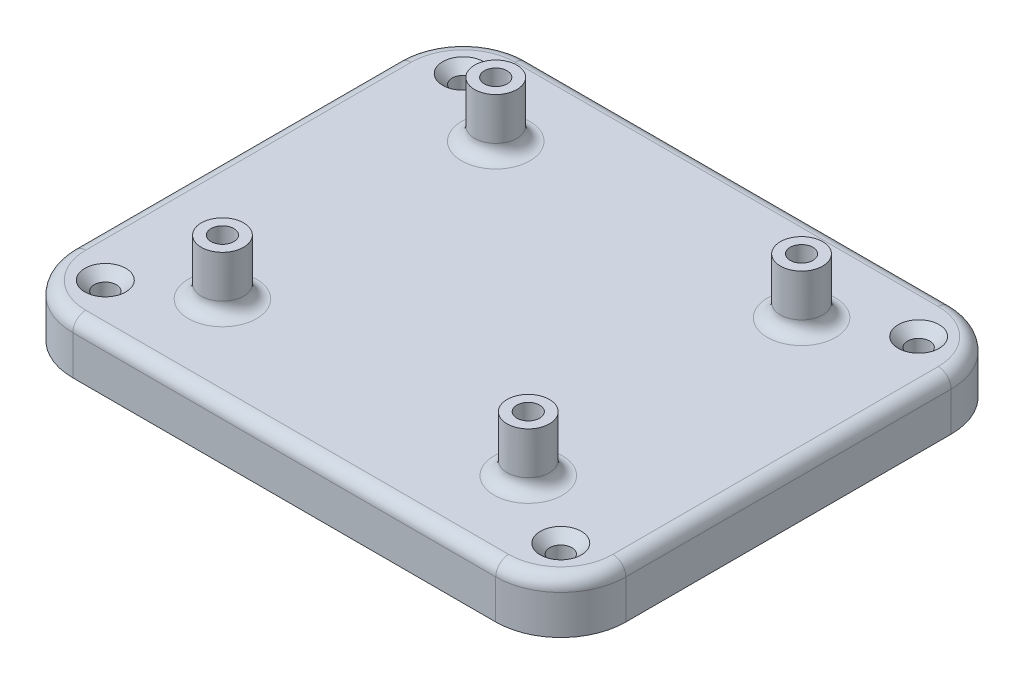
ISO-10303-21;
HEADER;
FILE_DESCRIPTION(('STEP AP214'),'2;1');
FILE_NAME('part.step','',(''),(''),'','','');
FILE_SCHEMA(('AUTOMOTIVE_DESIGN { 1 0 10303 214 1 1 1 1 }'));
ENDSEC;
DATA;
#1=APPLICATION_CONTEXT('core data for automotive mechanical design processes');
#2=APPLICATION_PROTOCOL_DEFINITION('international standard','automotive_design',2000,#1);
#3=PRODUCT_CONTEXT('',#1,'mechanical');
#4=PRODUCT('Part','Part','',(#3));
#5=PRODUCT_RELATED_PRODUCT_CATEGORY('part','',(#4));
#6=PRODUCT_DEFINITION_FORMATION('','',#4);
#7=PRODUCT_DEFINITION_CONTEXT('part definition',#1,'design');
#8=PRODUCT_DEFINITION('design','',#6,#7);
#9=PRODUCT_DEFINITION_SHAPE('','',#8);
#10=(LENGTH_UNIT() NAMED_UNIT(*) SI_UNIT(.MILLI.,.METRE.));
#11=(NAMED_UNIT(*) PLANE_ANGLE_UNIT() SI_UNIT($,.RADIAN.));
#12=(NAMED_UNIT(*) SI_UNIT($,.STERADIAN.) SOLID_ANGLE_UNIT());
#13=UNCERTAINTY_MEASURE_WITH_UNIT(LENGTH_MEASURE(1.E-05),#10,'distance_accuracy_value','');
#14=(GEOMETRIC_REPRESENTATION_CONTEXT(3) GLOBAL_UNCERTAINTY_ASSIGNED_CONTEXT((#13)) GLOBAL_UNIT_ASSIGNED_CONTEXT((#10,
#11,#12)) REPRESENTATION_CONTEXT('',''));
#15=CARTESIAN_POINT('',(0.,0.,0.));
#16=DIRECTION('',(0.,0.,1.));
#17=DIRECTION('',(1.,0.,0.));
#18=AXIS2_PLACEMENT_3D('',#15,#16,#17);
#19=CARTESIAN_POINT('',(-23.5,-4.,21.));
#20=DIRECTION('',(0.,1.,0.));
#21=DIRECTION('',(0.,0.,1.));
#22=AXIS2_PLACEMENT_3D('',#19,#20,#21);
#23=CYLINDRICAL_SURFACE('',#22,1.75);
#24=CARTESIAN_POINT('',(-23.5,12.5,21.));
#25=DIRECTION('',(0.,1.,0.));
#26=DIRECTION('',(0.,0.,1.));
#27=AXIS2_PLACEMENT_3D('',#24,#25,#26);
#28=CIRCLE('',#27,1.75);
#29=CARTESIAN_POINT('',(-23.5,12.5,22.75));
#30=VERTEX_POINT('',#29);
#31=EDGE_CURVE('E508',#30,#30,#28,.T.);
#32=ORIENTED_EDGE('',*,*,#31,.T.);
#33=EDGE_LOOP('',(#32));
#34=FACE_BOUND('',#33,.T.);
#35=CARTESIAN_POINT('',(-23.5,0.,21.));
#36=DIRECTION('',(0.,-1.,0.));
#37=DIRECTION('',(0.,0.,-1.));
#38=AXIS2_PLACEMENT_3D('',#35,#36,#37);
#39=CIRCLE('',#38,1.75);
#40=CARTESIAN_POINT('',(-23.5,0.,19.25));
#41=VERTEX_POINT('',#40);
#42=EDGE_CURVE('E37',#41,#41,#39,.F.);
#43=ORIENTED_EDGE('',*,*,#42,.F.);
#44=EDGE_LOOP('',(#43));
#45=FACE_BOUND('',#44,.T.);
#46=ADVANCED_FACE('F33',(#34,#45),#23,.F.);
#47=CARTESIAN_POINT('',(23.5,-4.,21.));
#48=DIRECTION('',(0.,1.,0.));
#49=DIRECTION('',(0.,0.,1.));
#50=AXIS2_PLACEMENT_3D('',#47,#48,#49);
#51=CYLINDRICAL_SURFACE('',#50,1.75);
#52=CARTESIAN_POINT('',(23.5,12.5,21.));
#53=DIRECTION('',(0.,1.,0.));
#54=DIRECTION('',(0.,0.,1.));
#55=AXIS2_PLACEMENT_3D('',#52,#53,#54);
#56=CIRCLE('',#55,1.75);
#57=CARTESIAN_POINT('',(23.5,12.5,22.75));
#58=VERTEX_POINT('',#57);
#59=EDGE_CURVE('E504',#58,#58,#56,.T.);
#60=ORIENTED_EDGE('',*,*,#59,.T.);
#61=EDGE_LOOP('',(#60));
#62=FACE_BOUND('',#61,.T.);
#63=CARTESIAN_POINT('',(23.5,0.,21.));
#64=DIRECTION('',(0.,-1.,0.));
#65=DIRECTION('',(0.,0.,-1.));
#66=AXIS2_PLACEMENT_3D('',#63,#64,#65);
#67=CIRCLE('',#66,1.75);
#68=CARTESIAN_POINT('',(23.5,0.,19.25));
#69=VERTEX_POINT('',#68);
#70=EDGE_CURVE('E648',#69,#69,#67,.F.);
#71=ORIENTED_EDGE('',*,*,#70,.F.);
#72=EDGE_LOOP('',(#71));
#73=FACE_BOUND('',#72,.T.);
#74=ADVANCED_FACE('F657',(#62,#73),#51,.F.);
#75=CARTESIAN_POINT('',(23.5,-4.,-21.));
#76=DIRECTION('',(0.,1.,0.));
#77=DIRECTION('',(0.,0.,1.));
#78=AXIS2_PLACEMENT_3D('',#75,#76,#77);
#79=CYLINDRICAL_SURFACE('',#78,1.75);
#80=CARTESIAN_POINT('',(23.5,12.5,-21.));
#81=DIRECTION('',(0.,1.,0.));
#82=DIRECTION('',(0.,0.,1.));
#83=AXIS2_PLACEMENT_3D('',#80,#81,#82);
#84=CIRCLE('',#83,1.75);
#85=CARTESIAN_POINT('',(23.5,12.5,-19.25));
#86=VERTEX_POINT('',#85);
#87=EDGE_CURVE('E509',#86,#86,#84,.T.);
#88=ORIENTED_EDGE('',*,*,#87,.T.);
#89=EDGE_LOOP('',(#88));
#90=FACE_BOUND('',#89,.T.);
#91=CARTESIAN_POINT('',(23.5,0.,-21.));
#92=DIRECTION('',(0.,-1.,0.));
#93=DIRECTION('',(0.,0.,-1.));
#94=AXIS2_PLACEMENT_3D('',#91,#92,#93);
#95=CIRCLE('',#94,1.75);
#96=CARTESIAN_POINT('',(23.5,0.,-22.75));
#97=VERTEX_POINT('',#96);
#98=EDGE_CURVE('E646',#97,#97,#95,.F.);
#99=ORIENTED_EDGE('',*,*,#98,.F.);
#100=EDGE_LOOP('',(#99));
#101=FACE_BOUND('',#100,.T.);
#102=ADVANCED_FACE('F663',(#90,#101),#79,.F.);
#103=CARTESIAN_POINT('',(-23.5,-4.,-21.));
#104=DIRECTION('',(0.,1.,0.));
#105=DIRECTION('',(0.,0.,1.));
#106=AXIS2_PLACEMENT_3D('',#103,#104,#105);
#107=CYLINDRICAL_SURFACE('',#106,1.75);
#108=CARTESIAN_POINT('',(-23.5,12.5,-21.));
#109=DIRECTION('',(0.,1.,0.));
#110=DIRECTION('',(0.,0.,1.));
#111=AXIS2_PLACEMENT_3D('',#108,#109,#110);
#112=CIRCLE('',#111,1.75);
#113=CARTESIAN_POINT('',(-23.5,12.5,-19.25));
#114=VERTEX_POINT('',#113);
#115=EDGE_CURVE('E505',#114,#114,#112,.T.);
#116=ORIENTED_EDGE('',*,*,#115,.T.);
#117=EDGE_LOOP('',(#116));
#118=FACE_BOUND('',#117,.T.);
#119=CARTESIAN_POINT('',(-23.5,0.,-21.));
#120=DIRECTION('',(0.,-1.,0.));
#121=DIRECTION('',(0.,0.,-1.));
#122=AXIS2_PLACEMENT_3D('',#119,#120,#121);
#123=CIRCLE('',#122,1.75);
#124=CARTESIAN_POINT('',(-23.5,0.,-22.75));
#125=VERTEX_POINT('',#124);
#126=EDGE_CURVE('E456',#125,#125,#123,.F.);
#127=ORIENTED_EDGE('',*,*,#126,.F.);
#128=EDGE_LOOP('',(#127));
#129=FACE_BOUND('',#128,.T.);
#130=ADVANCED_FACE('F724',(#118,#129),#107,.F.);
#131=CARTESIAN_POINT('',(42.5,4.,35.));
#132=DIRECTION('',(-1.,0.,0.));
#133=DIRECTION('',(0.,0.,1.));
#134=AXIS2_PLACEMENT_3D('',#131,#132,#133);
#135=PLANE('',#134);
#136=DIRECTION('',(0.,-1.,0.));
#137=VECTOR('',#136,1.);
#138=CARTESIAN_POINT('',(42.5,4.,-25.));
#139=LINE('',#138,#137);
#140=CARTESIAN_POINT('',(42.5,-4.,-25.));
#141=VERTEX_POINT('',#140);
#142=CARTESIAN_POINT('',(42.5,2.,-25.));
#143=VERTEX_POINT('',#142);
#144=EDGE_CURVE('E584',#141,#143,#139,.F.);
#145=ORIENTED_EDGE('',*,*,#144,.T.);
#146=DIRECTION('',(0.,0.,-1.));
#147=VECTOR('',#146,1.);
#148=CARTESIAN_POINT('',(42.5,2.,35.));
#149=LINE('',#148,#147);
#150=CARTESIAN_POINT('',(42.5,2.,25.));
#151=VERTEX_POINT('',#150);
#152=EDGE_CURVE('E11',#143,#151,#149,.F.);
#153=ORIENTED_EDGE('',*,*,#152,.T.);
#154=DIRECTION('',(0.,-1.,0.));
#155=VECTOR('',#154,1.);
#156=CARTESIAN_POINT('',(42.5,4.,25.));
#157=LINE('',#156,#155);
#158=CARTESIAN_POINT('',(42.5,-4.,25.));
#159=VERTEX_POINT('',#158);
#160=EDGE_CURVE('E582',#151,#159,#157,.T.);
#161=ORIENTED_EDGE('',*,*,#160,.T.);
#162=DIRECTION('',(0.,0.,-1.));
#163=VECTOR('',#162,1.);
#164=CARTESIAN_POINT('',(42.5,-4.,35.));
#165=LINE('',#164,#163);
#166=EDGE_CURVE('E528',#159,#141,#165,.T.);
#167=ORIENTED_EDGE('',*,*,#166,.T.);
#168=EDGE_LOOP('',(#145,#153,#161,#167));
#169=FACE_BOUND('',#168,.T.);
#170=ADVANCED_FACE('F720',(#169),#135,.F.);
#171=CARTESIAN_POINT('',(-42.5,4.,-35.));
#172=DIRECTION('',(0.,0.,1.));
#173=DIRECTION('',(1.,0.,0.));
#174=AXIS2_PLACEMENT_3D('',#171,#172,#173);
#175=PLANE('',#174);
#176=DIRECTION('',(0.,-1.,0.));
#177=VECTOR('',#176,1.);
#178=CARTESIAN_POINT('',(-32.5,4.,-35.));
#179=LINE('',#178,#177);
#180=CARTESIAN_POINT('',(-32.5,-4.,-35.));
#181=VERTEX_POINT('',#180);
#182=CARTESIAN_POINT('',(-32.5,2.,-35.));
#183=VERTEX_POINT('',#182);
#184=EDGE_CURVE('E579',#181,#183,#179,.F.);
#185=ORIENTED_EDGE('',*,*,#184,.T.);
#186=DIRECTION('',(-1.,0.,0.));
#187=VECTOR('',#186,1.);
#188=CARTESIAN_POINT('',(-42.5,2.,-35.));
#189=LINE('',#188,#187);
#190=CARTESIAN_POINT('',(32.5,2.,-35.));
#191=VERTEX_POINT('',#190);
#192=EDGE_CURVE('E620',#183,#191,#189,.F.);
#193=ORIENTED_EDGE('',*,*,#192,.T.);
#194=DIRECTION('',(0.,-1.,0.));
#195=VECTOR('',#194,1.);
#196=CARTESIAN_POINT('',(32.5,4.,-35.));
#197=LINE('',#196,#195);
#198=CARTESIAN_POINT('',(32.5,-4.,-35.));
#199=VERTEX_POINT('',#198);
#200=EDGE_CURVE('E577',#191,#199,#197,.T.);
#201=ORIENTED_EDGE('',*,*,#200,.T.);
#202=DIRECTION('',(-1.,0.,0.));
#203=VECTOR('',#202,1.);
#204=CARTESIAN_POINT('',(-42.5,-4.,-35.));
#205=LINE('',#204,#203);
#206=EDGE_CURVE('E531',#199,#181,#205,.T.);
#207=ORIENTED_EDGE('',*,*,#206,.T.);
#208=EDGE_LOOP('',(#185,#193,#201,#207));
#209=FACE_BOUND('',#208,.T.);
#210=ADVANCED_FACE('F716',(#209),#175,.F.);
#211=CARTESIAN_POINT('',(-42.5,4.,35.));
#212=DIRECTION('',(1.,0.,0.));
#213=DIRECTION('',(0.,0.,-1.));
#214=AXIS2_PLACEMENT_3D('',#211,#212,#213);
#215=PLANE('',#214);
#216=DIRECTION('',(0.,-1.,0.));
#217=VECTOR('',#216,1.);
#218=CARTESIAN_POINT('',(-42.5,4.,25.));
#219=LINE('',#218,#217);
#220=CARTESIAN_POINT('',(-42.5,-4.,25.));
#221=VERTEX_POINT('',#220);
#222=CARTESIAN_POINT('',(-42.5,2.,25.));
#223=VERTEX_POINT('',#222);
#224=EDGE_CURVE('E564',#221,#223,#219,.F.);
#225=ORIENTED_EDGE('',*,*,#224,.T.);
#226=DIRECTION('',(0.,0.,1.));
#227=VECTOR('',#226,1.);
#228=CARTESIAN_POINT('',(-42.5,2.,35.));
#229=LINE('',#228,#227);
#230=CARTESIAN_POINT('',(-42.5,2.,-25.));
#231=VERTEX_POINT('',#230);
#232=EDGE_CURVE('E616',#223,#231,#229,.F.);
#233=ORIENTED_EDGE('',*,*,#232,.T.);
#234=DIRECTION('',(0.,-1.,0.));
#235=VECTOR('',#234,1.);
#236=CARTESIAN_POINT('',(-42.5,4.,-25.));
#237=LINE('',#236,#235);
#238=CARTESIAN_POINT('',(-42.5,-4.,-25.));
#239=VERTEX_POINT('',#238);
#240=EDGE_CURVE('E567',#231,#239,#237,.T.);
#241=ORIENTED_EDGE('',*,*,#240,.T.);
#242=DIRECTION('',(0.,0.,1.));
#243=VECTOR('',#242,1.);
#244=CARTESIAN_POINT('',(-42.5,-4.,35.));
#245=LINE('',#244,#243);
#246=EDGE_CURVE('E534',#239,#221,#245,.T.);
#247=ORIENTED_EDGE('',*,*,#246,.T.);
#248=EDGE_LOOP('',(#225,#233,#241,#247));
#249=FACE_BOUND('',#248,.T.);
#250=ADVANCED_FACE('F712',(#249),#215,.F.);
#251=CARTESIAN_POINT('',(-42.5,4.,35.));
#252=DIRECTION('',(0.,0.,-1.));
#253=DIRECTION('',(-1.,0.,0.));
#254=AXIS2_PLACEMENT_3D('',#251,#252,#253);
#255=PLANE('',#254);
#256=DIRECTION('',(0.,-1.,0.));
#257=VECTOR('',#256,1.);
#258=CARTESIAN_POINT('',(32.5,4.,35.));
#259=LINE('',#258,#257);
#260=CARTESIAN_POINT('',(32.5,-4.,35.));
#261=VERTEX_POINT('',#260);
#262=CARTESIAN_POINT('',(32.5,2.,35.));
#263=VERTEX_POINT('',#262);
#264=EDGE_CURVE('E589',#261,#263,#259,.F.);
#265=ORIENTED_EDGE('',*,*,#264,.T.);
#266=DIRECTION('',(1.,0.,0.));
#267=VECTOR('',#266,1.);
#268=CARTESIAN_POINT('',(-42.5,2.,35.));
#269=LINE('',#268,#267);
#270=CARTESIAN_POINT('',(-32.5,2.,35.));
#271=VERTEX_POINT('',#270);
#272=EDGE_CURVE('E612',#263,#271,#269,.F.);
#273=ORIENTED_EDGE('',*,*,#272,.T.);
#274=DIRECTION('',(0.,-1.,0.));
#275=VECTOR('',#274,1.);
#276=CARTESIAN_POINT('',(-32.5,4.,35.));
#277=LINE('',#276,#275);
#278=CARTESIAN_POINT('',(-32.5,-4.,35.));
#279=VERTEX_POINT('',#278);
#280=EDGE_CURVE('E587',#271,#279,#277,.T.);
#281=ORIENTED_EDGE('',*,*,#280,.T.);
#282=DIRECTION('',(1.,0.,0.));
#283=VECTOR('',#282,1.);
#284=CARTESIAN_POINT('',(-42.5,-4.,35.));
#285=LINE('',#284,#283);
#286=EDGE_CURVE('E537',#279,#261,#285,.T.);
#287=ORIENTED_EDGE('',*,*,#286,.T.);
#288=EDGE_LOOP('',(#265,#273,#281,#287));
#289=FACE_BOUND('',#288,.T.);
#290=ADVANCED_FACE('F705',(#289),#255,.F.);
#291=CARTESIAN_POINT('',(0.,4.,0.));
#292=DIRECTION('',(0.,-1.,0.));
#293=DIRECTION('',(0.,0.,-1.));
#294=AXIS2_PLACEMENT_3D('',#291,#292,#293);
#295=PLANE('',#294);
#296=DIRECTION('',(1.,0.,0.));
#297=VECTOR('',#296,1.);
#298=CARTESIAN_POINT('',(0.,4.,33.));
#299=LINE('',#298,#297);
#300=CARTESIAN_POINT('',(-32.5,4.,33.));
#301=VERTEX_POINT('',#300);
#302=CARTESIAN_POINT('',(32.5,4.,33.));
#303=VERTEX_POINT('',#302);
#304=EDGE_CURVE('E604',#301,#303,#299,.T.);
#305=ORIENTED_EDGE('',*,*,#304,.T.);
#306=CARTESIAN_POINT('',(32.5,4.,25.));
#307=DIRECTION('',(0.,-1.,0.));
#308=DIRECTION('',(0.,0.,-1.));
#309=AXIS2_PLACEMENT_3D('',#306,#307,#308);
#310=CIRCLE('',#309,8.);
#311=CARTESIAN_POINT('',(40.5,4.,25.));
#312=VERTEX_POINT('',#311);
#313=EDGE_CURVE('E606',#303,#312,#310,.F.);
#314=ORIENTED_EDGE('',*,*,#313,.T.);
#315=DIRECTION('',(0.,0.,-1.));
#316=VECTOR('',#315,1.);
#317=CARTESIAN_POINT('',(40.5,4.,0.));
#318=LINE('',#317,#316);
#319=CARTESIAN_POINT('',(40.5,4.,-25.));
#320=VERTEX_POINT('',#319);
#321=EDGE_CURVE('E592',#312,#320,#318,.T.);
#322=ORIENTED_EDGE('',*,*,#321,.T.);
#323=CARTESIAN_POINT('',(32.5,4.,-25.));
#324=DIRECTION('',(0.,-1.,0.));
#325=DIRECTION('',(0.,0.,-1.));
#326=AXIS2_PLACEMENT_3D('',#323,#324,#325);
#327=CIRCLE('',#326,8.);
#328=CARTESIAN_POINT('',(32.5,4.,-33.));
#329=VERTEX_POINT('',#328);
#330=EDGE_CURVE('E594',#320,#329,#327,.F.);
#331=ORIENTED_EDGE('',*,*,#330,.T.);
#332=DIRECTION('',(-1.,0.,0.));
#333=VECTOR('',#332,1.);
#334=CARTESIAN_POINT('',(0.,4.,-33.));
#335=LINE('',#334,#333);
#336=CARTESIAN_POINT('',(-32.5,4.,-33.));
#337=VERTEX_POINT('',#336);
#338=EDGE_CURVE('E596',#329,#337,#335,.T.);
#339=ORIENTED_EDGE('',*,*,#338,.T.);
#340=CARTESIAN_POINT('',(-32.5,4.,-25.));
#341=DIRECTION('',(0.,-1.,0.));
#342=DIRECTION('',(0.,0.,-1.));
#343=AXIS2_PLACEMENT_3D('',#340,#341,#342);
#344=CIRCLE('',#343,8.);
#345=CARTESIAN_POINT('',(-40.5,4.,-25.));
#346=VERTEX_POINT('',#345);
#347=EDGE_CURVE('E598',#337,#346,#344,.F.);
#348=ORIENTED_EDGE('',*,*,#347,.T.);
#349=DIRECTION('',(0.,0.,1.));
#350=VECTOR('',#349,1.);
#351=CARTESIAN_POINT('',(-40.5,4.,0.));
#352=LINE('',#351,#350);
#353=CARTESIAN_POINT('',(-40.5,4.,25.));
#354=VERTEX_POINT('',#353);
#355=EDGE_CURVE('E600',#346,#354,#352,.T.);
#356=ORIENTED_EDGE('',*,*,#355,.T.);
#357=CARTESIAN_POINT('',(-32.5,4.,25.));
#358=DIRECTION('',(0.,-1.,0.));
#359=DIRECTION('',(0.,0.,-1.));
#360=AXIS2_PLACEMENT_3D('',#357,#358,#359);
#361=CIRCLE('',#360,8.);
#362=EDGE_CURVE('E602',#354,#301,#361,.F.);
#363=ORIENTED_EDGE('',*,*,#362,.T.);
#364=EDGE_LOOP('',(#305,#314,#322,#331,#339,#348,#356,#363));
#365=FACE_BOUND('',#364,.T.);
#366=CARTESIAN_POINT('',(23.5,4.,-21.));
#367=DIRECTION('',(0.,-1.,0.));
#368=DIRECTION('',(0.,0.,-1.));
#369=AXIS2_PLACEMENT_3D('',#366,#367,#368);
#370=CIRCLE('',#369,5.25);
#371=CARTESIAN_POINT('',(23.5,4.,-26.25));
#372=VERTEX_POINT('',#371);
#373=EDGE_CURVE('E552',#372,#372,#370,.T.);
#374=ORIENTED_EDGE('',*,*,#373,.T.);
#375=EDGE_LOOP('',(#374));
#376=FACE_BOUND('',#375,.T.);
#377=CARTESIAN_POINT('',(23.5,4.,21.));
#378=DIRECTION('',(0.,-1.,0.));
#379=DIRECTION('',(0.,0.,-1.));
#380=AXIS2_PLACEMENT_3D('',#377,#378,#379);
#381=CIRCLE('',#380,5.25);
#382=CARTESIAN_POINT('',(23.5,4.,15.75));
#383=VERTEX_POINT('',#382);
#384=EDGE_CURVE('E549',#383,#383,#381,.T.);
#385=ORIENTED_EDGE('',*,*,#384,.T.);
#386=EDGE_LOOP('',(#385));
#387=FACE_BOUND('',#386,.T.);
#388=CARTESIAN_POINT('',(-23.5,4.,-21.));
#389=DIRECTION('',(0.,-1.,0.));
#390=DIRECTION('',(0.,0.,-1.));
#391=AXIS2_PLACEMENT_3D('',#388,#389,#390);
#392=CIRCLE('',#391,5.25);
#393=CARTESIAN_POINT('',(-23.5,4.,-26.25));
#394=VERTEX_POINT('',#393);
#395=EDGE_CURVE('E546',#394,#394,#392,.T.);
#396=ORIENTED_EDGE('',*,*,#395,.T.);
#397=EDGE_LOOP('',(#396));
#398=FACE_BOUND('',#397,.T.);
#399=CARTESIAN_POINT('',(-23.5,4.,21.));
#400=DIRECTION('',(0.,-1.,0.));
#401=DIRECTION('',(0.,0.,-1.));
#402=AXIS2_PLACEMENT_3D('',#399,#400,#401);
#403=CIRCLE('',#402,5.25);
#404=CARTESIAN_POINT('',(-23.5,4.,15.75));
#405=VERTEX_POINT('',#404);
#406=EDGE_CURVE('E543',#405,#405,#403,.T.);
#407=ORIENTED_EDGE('',*,*,#406,.T.);
#408=EDGE_LOOP('',(#407));
#409=FACE_BOUND('',#408,.T.);
#410=CARTESIAN_POINT('',(-35.,4.,-27.5));
#411=DIRECTION('',(0.,1.,0.));
#412=DIRECTION('',(0.,0.,1.));
#413=AXIS2_PLACEMENT_3D('',#410,#411,#412);
#414=CIRCLE('',#413,3.15);
#415=CARTESIAN_POINT('',(-35.,4.,-24.35));
#416=VERTEX_POINT('',#415);
#417=EDGE_CURVE('E467',#416,#416,#414,.T.);
#418=ORIENTED_EDGE('',*,*,#417,.F.);
#419=EDGE_LOOP('',(#418));
#420=FACE_BOUND('',#419,.T.);
#421=CARTESIAN_POINT('',(35.,4.,-27.5));
#422=DIRECTION('',(0.,1.,0.));
#423=DIRECTION('',(0.,0.,1.));
#424=AXIS2_PLACEMENT_3D('',#421,#422,#423);
#425=CIRCLE('',#424,3.15);
#426=CARTESIAN_POINT('',(35.,4.,-24.35));
#427=VERTEX_POINT('',#426);
#428=EDGE_CURVE('E477',#427,#427,#425,.T.);
#429=ORIENTED_EDGE('',*,*,#428,.F.);
#430=EDGE_LOOP('',(#429));
#431=FACE_BOUND('',#430,.T.);
#432=CARTESIAN_POINT('',(35.,4.,27.5));
#433=DIRECTION('',(0.,1.,0.));
#434=DIRECTION('',(0.,0.,1.));
#435=AXIS2_PLACEMENT_3D('',#432,#433,#434);
#436=CIRCLE('',#435,3.15);
#437=CARTESIAN_POINT('',(35.,4.,30.65));
#438=VERTEX_POINT('',#437);
#439=EDGE_CURVE('E486',#438,#438,#436,.T.);
#440=ORIENTED_EDGE('',*,*,#439,.F.);
#441=EDGE_LOOP('',(#440));
#442=FACE_BOUND('',#441,.T.);
#443=CARTESIAN_POINT('',(-35.,4.,27.5));
#444=DIRECTION('',(0.,1.,0.));
#445=DIRECTION('',(0.,0.,1.));
#446=AXIS2_PLACEMENT_3D('',#443,#444,#445);
#447=CIRCLE('',#446,3.15);
#448=CARTESIAN_POINT('',(-35.,4.,30.65));
#449=VERTEX_POINT('',#448);
#450=EDGE_CURVE('E495',#449,#449,#447,.T.);
#451=ORIENTED_EDGE('',*,*,#450,.F.);
#452=EDGE_LOOP('',(#451));
#453=FACE_BOUND('',#452,.T.);
#454=ADVANCED_FACE('F702',(#365,#376,#387,#398,#409,#420,#431,#442,#453),#295,.F.);
#455=CARTESIAN_POINT('',(0.,-4.,0.));
#456=DIRECTION('',(0.,-1.,0.));
#457=DIRECTION('',(0.,0.,-1.));
#458=AXIS2_PLACEMENT_3D('',#455,#456,#457);
#459=PLANE('',#458);
#460=DIRECTION('',(-0.125734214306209,0.,0.992063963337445));
#461=VECTOR('',#460,1.);
#462=CARTESIAN_POINT('',(-20.5721942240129,-4.,-22.229344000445));
#463=LINE('',#462,#461);
#464=CARTESIAN_POINT('',(-20.5721942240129,-4.,-22.229344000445));
#465=VERTEX_POINT('',#464);
#466=CARTESIAN_POINT('',(-20.9714539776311,-4.,-19.0791178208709));
#467=VERTEX_POINT('',#466);
#468=EDGE_CURVE('E50',#465,#467,#463,.T.);
#469=ORIENTED_EDGE('',*,*,#468,.F.);
#470=DIRECTION('',(0.796285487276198,0.,0.604921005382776));
#471=VECTOR('',#470,1.);
#472=CARTESIAN_POINT('',(-23.1007402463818,-4.,-24.1502261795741));
#473=LINE('',#472,#471);
#474=CARTESIAN_POINT('',(-23.1007402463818,-4.,-24.1502261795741));
#475=VERTEX_POINT('',#474);
#476=EDGE_CURVE('E378',#475,#465,#473,.T.);
#477=ORIENTED_EDGE('',*,*,#476,.F.);
#478=DIRECTION('',(0.922019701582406,0.,-0.387142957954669));
#479=VECTOR('',#478,1.);
#480=CARTESIAN_POINT('',(-26.0285460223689,-4.,-22.9208821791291));
#481=LINE('',#480,#479);
#482=CARTESIAN_POINT('',(-26.0285460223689,-4.,-22.9208821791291));
#483=VERTEX_POINT('',#482);
#484=EDGE_CURVE('E404',#483,#475,#481,.T.);
#485=ORIENTED_EDGE('',*,*,#484,.F.);
#486=DIRECTION('',(0.125734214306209,0.,-0.992063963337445));
#487=VECTOR('',#486,1.);
#488=CARTESIAN_POINT('',(-26.4278057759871,-4.,-19.770655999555));
#489=LINE('',#488,#487);
#490=CARTESIAN_POINT('',(-26.4278057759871,-4.,-19.770655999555));
#491=VERTEX_POINT('',#490);
#492=EDGE_CURVE('E401',#491,#483,#489,.T.);
#493=ORIENTED_EDGE('',*,*,#492,.F.);
#494=DIRECTION('',(-0.796285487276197,0.,-0.604921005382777));
#495=VECTOR('',#494,1.);
#496=CARTESIAN_POINT('',(-23.8992597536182,-4.,-17.8497738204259));
#497=LINE('',#496,#495);
#498=CARTESIAN_POINT('',(-23.8992597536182,-4.,-17.8497738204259));
#499=VERTEX_POINT('',#498);
#500=EDGE_CURVE('E398',#499,#491,#497,.T.);
#501=ORIENTED_EDGE('',*,*,#500,.F.);
#502=DIRECTION('',(-0.922019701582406,0.,0.38714295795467));
#503=VECTOR('',#502,1.);
#504=CARTESIAN_POINT('',(-20.9714539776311,-4.,-19.0791178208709));
#505=LINE('',#504,#503);
#506=EDGE_CURVE('E395',#467,#499,#505,.T.);
#507=ORIENTED_EDGE('',*,*,#506,.F.);
#508=EDGE_LOOP('',(#469,#477,#485,#493,#501,#507));
#509=FACE_BOUND('',#508,.T.);
#510=DIRECTION('',(-0.20851747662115,0.,0.978018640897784));
#511=VECTOR('',#510,1.);
#512=CARTESIAN_POINT('',(26.5206172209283,-4.,-21.9793900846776));
#513=LINE('',#512,#511);
#514=CARTESIAN_POINT('',(26.5206172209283,-4.,-21.9793900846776));
#515=VERTEX_POINT('',#514);
#516=CARTESIAN_POINT('',(25.8584853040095,-4.,-18.8737637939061));
#517=VERTEX_POINT('',#516);
#518=EDGE_CURVE('E58',#515,#517,#513,.T.);
#519=ORIENTED_EDGE('',*,*,#518,.F.);
#520=DIRECTION('',(0.742730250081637,0.,0.669590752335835));
#521=VECTOR('',#520,1.);
#522=CARTESIAN_POINT('',(24.1621319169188,-4.,-24.1056262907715));
#523=LINE('',#522,#521);
#524=CARTESIAN_POINT('',(24.1621319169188,-4.,-24.1056262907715));
#525=VERTEX_POINT('',#524);
#526=EDGE_CURVE('E332',#525,#515,#523,.T.);
#527=ORIENTED_EDGE('',*,*,#526,.F.);
#528=DIRECTION('',(0.951247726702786,0.,-0.308427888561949));
#529=VECTOR('',#528,1.);
#530=CARTESIAN_POINT('',(21.1415146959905,-4.,-23.1262362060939));
#531=LINE('',#530,#529);
#532=CARTESIAN_POINT('',(21.1415146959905,-4.,-23.1262362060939));
#533=VERTEX_POINT('',#532);
#534=EDGE_CURVE('E359',#533,#525,#531,.T.);
#535=ORIENTED_EDGE('',*,*,#534,.F.);
#536=DIRECTION('',(0.208517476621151,0.,-0.978018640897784));
#537=VECTOR('',#536,1.);
#538=CARTESIAN_POINT('',(20.4793827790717,-4.,-20.0206099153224));
#539=LINE('',#538,#537);
#540=CARTESIAN_POINT('',(20.4793827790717,-4.,-20.0206099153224));
#541=VERTEX_POINT('',#540);
#542=EDGE_CURVE('E356',#541,#533,#539,.T.);
#543=ORIENTED_EDGE('',*,*,#542,.F.);
#544=DIRECTION('',(-0.742730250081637,0.,-0.669590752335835));
#545=VECTOR('',#544,1.);
#546=CARTESIAN_POINT('',(22.8378680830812,-4.,-17.8943737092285));
#547=LINE('',#546,#545);
#548=CARTESIAN_POINT('',(22.8378680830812,-4.,-17.8943737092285));
#549=VERTEX_POINT('',#548);
#550=EDGE_CURVE('E353',#549,#541,#547,.T.);
#551=ORIENTED_EDGE('',*,*,#550,.F.);
#552=DIRECTION('',(-0.951247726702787,0.,0.308427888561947));
#553=VECTOR('',#552,1.);
#554=CARTESIAN_POINT('',(25.8584853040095,-4.,-18.8737637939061));
#555=LINE('',#554,#553);
#556=EDGE_CURVE('E349',#517,#549,#555,.T.);
#557=ORIENTED_EDGE('',*,*,#556,.F.);
#558=EDGE_LOOP('',(#519,#527,#535,#543,#551,#557));
#559=FACE_BOUND('',#558,.T.);
#560=DIRECTION('',(0.5,0.,0.866025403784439));
#561=VECTOR('',#560,1.);
#562=CARTESIAN_POINT('',(25.0877132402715,-4.,18.25));
#563=LINE('',#562,#561);
#564=CARTESIAN_POINT('',(25.0877132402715,-4.,18.25));
#565=VERTEX_POINT('',#564);
#566=CARTESIAN_POINT('',(26.675426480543,-4.,21.));
#567=VERTEX_POINT('',#566);
#568=EDGE_CURVE('E274',#565,#567,#563,.T.);
#569=ORIENTED_EDGE('',*,*,#568,.F.);
#570=DIRECTION('',(1.,0.,0.));
#571=VECTOR('',#570,1.);
#572=CARTESIAN_POINT('',(21.9122867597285,-4.,18.25));
#573=LINE('',#572,#571);
#574=CARTESIAN_POINT('',(21.9122867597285,-4.,18.25));
#575=VERTEX_POINT('',#574);
#576=EDGE_CURVE('E293',#575,#565,#573,.T.);
#577=ORIENTED_EDGE('',*,*,#576,.F.);
#578=DIRECTION('',(0.5,0.,-0.866025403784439));
#579=VECTOR('',#578,1.);
#580=CARTESIAN_POINT('',(20.324573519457,-4.,21.));
#581=LINE('',#580,#579);
#582=CARTESIAN_POINT('',(20.324573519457,-4.,21.));
#583=VERTEX_POINT('',#582);
#584=EDGE_CURVE('E296',#583,#575,#581,.T.);
#585=ORIENTED_EDGE('',*,*,#584,.F.);
#586=DIRECTION('',(-0.5,0.,-0.866025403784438));
#587=VECTOR('',#586,1.);
#588=CARTESIAN_POINT('',(21.9122867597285,-4.,23.75));
#589=LINE('',#588,#587);
#590=CARTESIAN_POINT('',(21.9122867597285,-4.,23.75));
#591=VERTEX_POINT('',#590);
#592=EDGE_CURVE('E313',#591,#583,#589,.T.);
#593=ORIENTED_EDGE('',*,*,#592,.F.);
#594=DIRECTION('',(-1.,0.,0.));
#595=VECTOR('',#594,1.);
#596=CARTESIAN_POINT('',(25.0877132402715,-4.,23.75));
#597=LINE('',#596,#595);
#598=CARTESIAN_POINT('',(25.0877132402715,-4.,23.75));
#599=VERTEX_POINT('',#598);
#600=EDGE_CURVE('E310',#599,#591,#597,.T.);
#601=ORIENTED_EDGE('',*,*,#600,.F.);
#602=DIRECTION('',(-0.5,0.,0.866025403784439));
#603=VECTOR('',#602,1.);
#604=CARTESIAN_POINT('',(26.675426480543,-4.,21.));
#605=LINE('',#604,#603);
#606=EDGE_CURVE('E307',#567,#599,#605,.T.);
#607=ORIENTED_EDGE('',*,*,#606,.F.);
#608=EDGE_LOOP('',(#569,#577,#585,#593,#601,#607));
#609=FACE_BOUND('',#608,.T.);
#610=DIRECTION('',(0.741678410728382,0.,0.670755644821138));
#611=VECTOR('',#610,1.);
#612=CARTESIAN_POINT('',(-22.8329946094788,-4.,17.8954167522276));
#613=LINE('',#612,#611);
#614=CARTESIAN_POINT('',(-22.8329946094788,-4.,17.8954167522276));
#615=VERTEX_POINT('',#614);
#616=CARTESIAN_POINT('',(-20.4778493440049,-4.,20.0253519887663));
#617=VERTEX_POINT('',#616);
#618=EDGE_CURVE('E320',#615,#617,#613,.T.);
#619=ORIENTED_EDGE('',*,*,#618,.F.);
#620=DIRECTION('',(0.951730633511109,0.,-0.306934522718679));
#621=VECTOR('',#620,1.);
#622=CARTESIAN_POINT('',(-25.8551452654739,-4.,18.8700647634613));
#623=LINE('',#622,#621);
#624=CARTESIAN_POINT('',(-25.8551452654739,-4.,18.8700647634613));
#625=VERTEX_POINT('',#624);
#626=EDGE_CURVE('E423',#625,#615,#623,.T.);
#627=ORIENTED_EDGE('',*,*,#626,.F.);
#628=DIRECTION('',(0.210052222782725,0.,-0.977690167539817));
#629=VECTOR('',#628,1.);
#630=CARTESIAN_POINT('',(-26.5221506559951,-4.,21.9746480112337));
#631=LINE('',#630,#629);
#632=CARTESIAN_POINT('',(-26.5221506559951,-4.,21.9746480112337));
#633=VERTEX_POINT('',#632);
#634=EDGE_CURVE('E449',#633,#625,#631,.T.);
#635=ORIENTED_EDGE('',*,*,#634,.F.);
#636=DIRECTION('',(-0.741678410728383,0.,-0.670755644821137));
#637=VECTOR('',#636,1.);
#638=CARTESIAN_POINT('',(-24.1670053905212,-4.,24.1045832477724));
#639=LINE('',#638,#637);
#640=CARTESIAN_POINT('',(-24.1670053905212,-4.,24.1045832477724));
#641=VERTEX_POINT('',#640);
#642=EDGE_CURVE('E446',#641,#633,#639,.T.);
#643=ORIENTED_EDGE('',*,*,#642,.F.);
#644=DIRECTION('',(-0.951730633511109,0.,0.306934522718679));
#645=VECTOR('',#644,1.);
#646=CARTESIAN_POINT('',(-21.1448547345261,-4.,23.1299352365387));
#647=LINE('',#646,#645);
#648=CARTESIAN_POINT('',(-21.1448547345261,-4.,23.1299352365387));
#649=VERTEX_POINT('',#648);
#650=EDGE_CURVE('E443',#649,#641,#647,.T.);
#651=ORIENTED_EDGE('',*,*,#650,.F.);
#652=DIRECTION('',(-0.210052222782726,0.,0.977690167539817));
#653=VECTOR('',#652,1.);
#654=CARTESIAN_POINT('',(-20.4778493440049,-4.,20.0253519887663));
#655=LINE('',#654,#653);
#656=EDGE_CURVE('E440',#617,#649,#655,.T.);
#657=ORIENTED_EDGE('',*,*,#656,.F.);
#658=EDGE_LOOP('',(#619,#627,#635,#643,#651,#657));
#659=FACE_BOUND('',#658,.T.);
#660=CARTESIAN_POINT('',(-35.,-4.,-27.5));
#661=DIRECTION('',(0.,1.,0.));
#662=DIRECTION('',(0.,0.,1.));
#663=AXIS2_PLACEMENT_3D('',#660,#661,#662);
#664=CIRCLE('',#663,1.7);
#665=CARTESIAN_POINT('',(-35.,-4.,-25.8));
#666=VERTEX_POINT('',#665);
#667=EDGE_CURVE('E474',#666,#666,#664,.T.);
#668=ORIENTED_EDGE('',*,*,#667,.T.);
#669=EDGE_LOOP('',(#668));
#670=FACE_BOUND('',#669,.T.);
#671=CARTESIAN_POINT('',(35.,-4.,-27.5));
#672=DIRECTION('',(0.,1.,0.));
#673=DIRECTION('',(0.,0.,1.));
#674=AXIS2_PLACEMENT_3D('',#671,#672,#673);
#675=CIRCLE('',#674,1.7);
#676=CARTESIAN_POINT('',(35.,-4.,-25.8));
#677=VERTEX_POINT('',#676);
#678=EDGE_CURVE('E483',#677,#677,#675,.T.);
#679=ORIENTED_EDGE('',*,*,#678,.T.);
#680=EDGE_LOOP('',(#679));
#681=FACE_BOUND('',#680,.T.);
#682=CARTESIAN_POINT('',(35.,-4.,27.5));
#683=DIRECTION('',(0.,1.,0.));
#684=DIRECTION('',(0.,0.,1.));
#685=AXIS2_PLACEMENT_3D('',#682,#683,#684);
#686=CIRCLE('',#685,1.7);
#687=CARTESIAN_POINT('',(35.,-4.,29.2));
#688=VERTEX_POINT('',#687);
#689=EDGE_CURVE('E492',#688,#688,#686,.T.);
#690=ORIENTED_EDGE('',*,*,#689,.T.);
#691=EDGE_LOOP('',(#690));
#692=FACE_BOUND('',#691,.T.);
#693=CARTESIAN_POINT('',(-35.,-4.,27.5));
#694=DIRECTION('',(0.,1.,0.));
#695=DIRECTION('',(0.,0.,1.));
#696=AXIS2_PLACEMENT_3D('',#693,#694,#695);
#697=CIRCLE('',#696,1.7);
#698=CARTESIAN_POINT('',(-35.,-4.,29.2));
#699=VERTEX_POINT('',#698);
#700=EDGE_CURVE('E501',#699,#699,#697,.T.);
#701=ORIENTED_EDGE('',*,*,#700,.T.);
#702=EDGE_LOOP('',(#701));
#703=FACE_BOUND('',#702,.T.);
#704=ORIENTED_EDGE('',*,*,#246,.F.);
#705=CARTESIAN_POINT('',(-32.5,-4.,-25.));
#706=DIRECTION('',(0.,-1.,0.));
#707=DIRECTION('',(0.,0.,-1.));
#708=AXIS2_PLACEMENT_3D('',#705,#706,#707);
#709=CIRCLE('',#708,10.);
#710=EDGE_CURVE('E575',#239,#181,#709,.T.);
#711=ORIENTED_EDGE('',*,*,#710,.T.);
#712=ORIENTED_EDGE('',*,*,#206,.F.);
#713=CARTESIAN_POINT('',(32.5,-4.,-25.));
#714=DIRECTION('',(0.,-1.,0.));
#715=DIRECTION('',(0.,0.,-1.));
#716=AXIS2_PLACEMENT_3D('',#713,#714,#715);
#717=CIRCLE('',#716,10.);
#718=EDGE_CURVE('E573',#199,#141,#717,.T.);
#719=ORIENTED_EDGE('',*,*,#718,.T.);
#720=ORIENTED_EDGE('',*,*,#166,.F.);
#721=CARTESIAN_POINT('',(32.5,-4.,25.));
#722=DIRECTION('',(0.,-1.,0.));
#723=DIRECTION('',(0.,0.,-1.));
#724=AXIS2_PLACEMENT_3D('',#721,#722,#723);
#725=CIRCLE('',#724,10.);
#726=EDGE_CURVE('E571',#159,#261,#725,.T.);
#727=ORIENTED_EDGE('',*,*,#726,.T.);
#728=ORIENTED_EDGE('',*,*,#286,.F.);
#729=CARTESIAN_POINT('',(-32.5,-4.,25.));
#730=DIRECTION('',(0.,-1.,0.));
#731=DIRECTION('',(0.,0.,-1.));
#732=AXIS2_PLACEMENT_3D('',#729,#730,#731);
#733=CIRCLE('',#732,10.);
#734=EDGE_CURVE('E569',#279,#221,#733,.T.);
#735=ORIENTED_EDGE('',*,*,#734,.T.);
#736=EDGE_LOOP('',(#704,#711,#712,#719,#720,#727,#728,#735));
#737=FACE_BOUND('',#736,.T.);
#738=ADVANCED_FACE('F700',(#509,#559,#609,#659,#670,#681,#692,#703,#737),#459,.T.);
#739=CARTESIAN_POINT('',(-23.5,12.5,-21.));
#740=DIRECTION('',(0.,-1.,0.));
#741=DIRECTION('',(0.,0.,-1.));
#742=AXIS2_PLACEMENT_3D('',#739,#740,#741);
#743=CYLINDRICAL_SURFACE('',#742,3.25);
#744=CARTESIAN_POINT('',(-23.5,6.,-21.));
#745=DIRECTION('',(0.,-1.,0.));
#746=DIRECTION('',(0.,0.,-1.));
#747=AXIS2_PLACEMENT_3D('',#744,#745,#746);
#748=CIRCLE('',#747,3.25);
#749=CARTESIAN_POINT('',(-23.5,6.,-24.25));
#750=VERTEX_POINT('',#749);
#751=EDGE_CURVE('E558',#750,#750,#748,.F.);
#752=ORIENTED_EDGE('',*,*,#751,.T.);
#753=EDGE_LOOP('',(#752));
#754=FACE_BOUND('',#753,.T.);
#755=CARTESIAN_POINT('',(-23.5,12.5,-21.));
#756=DIRECTION('',(0.,1.,0.));
#757=DIRECTION('',(0.,0.,1.));
#758=AXIS2_PLACEMENT_3D('',#755,#756,#757);
#759=CIRCLE('',#758,3.25);
#760=CARTESIAN_POINT('',(-23.5,12.5,-17.75));
#761=VERTEX_POINT('',#760);
#762=EDGE_CURVE('E525',#761,#761,#759,.T.);
#763=ORIENTED_EDGE('',*,*,#762,.F.);
#764=EDGE_LOOP('',(#763));
#765=FACE_BOUND('',#764,.T.);
#766=ADVANCED_FACE('F696',(#754,#765),#743,.T.);
#767=CARTESIAN_POINT('',(-23.5,12.5,-21.));
#768=DIRECTION('',(0.,1.,0.));
#769=DIRECTION('',(0.,0.,1.));
#770=AXIS2_PLACEMENT_3D('',#767,#768,#769);
#771=PLANE('',#770);
#772=ORIENTED_EDGE('',*,*,#115,.F.);
#773=EDGE_LOOP('',(#772));
#774=FACE_BOUND('',#773,.T.);
#775=ORIENTED_EDGE('',*,*,#762,.T.);
#776=EDGE_LOOP('',(#775));
#777=FACE_BOUND('',#776,.T.);
#778=ADVANCED_FACE('F692',(#774,#777),#771,.T.);
#779=CARTESIAN_POINT('',(23.5,12.5,-21.));
#780=DIRECTION('',(0.,-1.,0.));
#781=DIRECTION('',(0.,0.,-1.));
#782=AXIS2_PLACEMENT_3D('',#779,#780,#781);
#783=CYLINDRICAL_SURFACE('',#782,3.25);
#784=CARTESIAN_POINT('',(23.5,6.,-21.));
#785=DIRECTION('',(0.,-1.,0.));
#786=DIRECTION('',(0.,0.,-1.));
#787=AXIS2_PLACEMENT_3D('',#784,#785,#786);
#788=CIRCLE('',#787,3.25);
#789=CARTESIAN_POINT('',(23.5,6.,-24.25));
#790=VERTEX_POINT('',#789);
#791=EDGE_CURVE('E540',#790,#790,#788,.F.);
#792=ORIENTED_EDGE('',*,*,#791,.T.);
#793=EDGE_LOOP('',(#792));
#794=FACE_BOUND('',#793,.T.);
#795=CARTESIAN_POINT('',(23.5,12.5,-21.));
#796=DIRECTION('',(0.,1.,0.));
#797=DIRECTION('',(0.,0.,1.));
#798=AXIS2_PLACEMENT_3D('',#795,#796,#797);
#799=CIRCLE('',#798,3.25);
#800=CARTESIAN_POINT('',(23.5,12.5,-17.75));
#801=VERTEX_POINT('',#800);
#802=EDGE_CURVE('E522',#801,#801,#799,.T.);
#803=ORIENTED_EDGE('',*,*,#802,.F.);
#804=EDGE_LOOP('',(#803));
#805=FACE_BOUND('',#804,.T.);
#806=ADVANCED_FACE('F688',(#794,#805),#783,.T.);
#807=CARTESIAN_POINT('',(23.5,12.5,-21.));
#808=DIRECTION('',(0.,1.,0.));
#809=DIRECTION('',(0.,0.,1.));
#810=AXIS2_PLACEMENT_3D('',#807,#808,#809);
#811=PLANE('',#810);
#812=ORIENTED_EDGE('',*,*,#87,.F.);
#813=EDGE_LOOP('',(#812));
#814=FACE_BOUND('',#813,.T.);
#815=ORIENTED_EDGE('',*,*,#802,.T.);
#816=EDGE_LOOP('',(#815));
#817=FACE_BOUND('',#816,.T.);
#818=ADVANCED_FACE('F684',(#814,#817),#811,.T.);
#819=CARTESIAN_POINT('',(23.5,12.5,21.));
#820=DIRECTION('',(0.,-1.,0.));
#821=DIRECTION('',(0.,0.,-1.));
#822=AXIS2_PLACEMENT_3D('',#819,#820,#821);
#823=CYLINDRICAL_SURFACE('',#822,3.25);
#824=CARTESIAN_POINT('',(23.5,6.,21.));
#825=DIRECTION('',(0.,-1.,0.));
#826=DIRECTION('',(0.,0.,-1.));
#827=AXIS2_PLACEMENT_3D('',#824,#825,#826);
#828=CIRCLE('',#827,3.25);
#829=CARTESIAN_POINT('',(23.5,6.,17.75));
#830=VERTEX_POINT('',#829);
#831=EDGE_CURVE('E555',#830,#830,#828,.F.);
#832=ORIENTED_EDGE('',*,*,#831,.T.);
#833=EDGE_LOOP('',(#832));
#834=FACE_BOUND('',#833,.T.);
#835=CARTESIAN_POINT('',(23.5,12.5,21.));
#836=DIRECTION('',(0.,1.,0.));
#837=DIRECTION('',(0.,0.,1.));
#838=AXIS2_PLACEMENT_3D('',#835,#836,#837);
#839=CIRCLE('',#838,3.25);
#840=CARTESIAN_POINT('',(23.5,12.5,24.25));
#841=VERTEX_POINT('',#840);
#842=EDGE_CURVE('E519',#841,#841,#839,.T.);
#843=ORIENTED_EDGE('',*,*,#842,.F.);
#844=EDGE_LOOP('',(#843));
#845=FACE_BOUND('',#844,.T.);
#846=ADVANCED_FACE('F680',(#834,#845),#823,.T.);
#847=CARTESIAN_POINT('',(23.5,12.5,21.));
#848=DIRECTION('',(0.,1.,0.));
#849=DIRECTION('',(0.,0.,1.));
#850=AXIS2_PLACEMENT_3D('',#847,#848,#849);
#851=PLANE('',#850);
#852=ORIENTED_EDGE('',*,*,#59,.F.);
#853=EDGE_LOOP('',(#852));
#854=FACE_BOUND('',#853,.T.);
#855=ORIENTED_EDGE('',*,*,#842,.T.);
#856=EDGE_LOOP('',(#855));
#857=FACE_BOUND('',#856,.T.);
#858=ADVANCED_FACE('F676',(#854,#857),#851,.T.);
#859=CARTESIAN_POINT('',(-23.5,12.5,21.));
#860=DIRECTION('',(0.,-1.,0.));
#861=DIRECTION('',(0.,0.,-1.));
#862=AXIS2_PLACEMENT_3D('',#859,#860,#861);
#863=CYLINDRICAL_SURFACE('',#862,3.25);
#864=CARTESIAN_POINT('',(-23.5,6.,21.));
#865=DIRECTION('',(0.,-1.,0.));
#866=DIRECTION('',(0.,0.,-1.));
#867=AXIS2_PLACEMENT_3D('',#864,#865,#866);
#868=CIRCLE('',#867,3.25);
#869=CARTESIAN_POINT('',(-23.5,6.,17.75));
#870=VERTEX_POINT('',#869);
#871=EDGE_CURVE('E561',#870,#870,#868,.F.);
#872=ORIENTED_EDGE('',*,*,#871,.T.);
#873=EDGE_LOOP('',(#872));
#874=FACE_BOUND('',#873,.T.);
#875=CARTESIAN_POINT('',(-23.5,12.5,21.));
#876=DIRECTION('',(0.,1.,0.));
#877=DIRECTION('',(0.,0.,1.));
#878=AXIS2_PLACEMENT_3D('',#875,#876,#877);
#879=CIRCLE('',#878,3.25);
#880=CARTESIAN_POINT('',(-23.5,12.5,24.25));
#881=VERTEX_POINT('',#880);
#882=EDGE_CURVE('E516',#881,#881,#879,.T.);
#883=ORIENTED_EDGE('',*,*,#882,.F.);
#884=EDGE_LOOP('',(#883));
#885=FACE_BOUND('',#884,.T.);
#886=ADVANCED_FACE('F672',(#874,#885),#863,.T.);
#887=CARTESIAN_POINT('',(-23.5,12.5,21.));
#888=DIRECTION('',(0.,1.,0.));
#889=DIRECTION('',(0.,0.,1.));
#890=AXIS2_PLACEMENT_3D('',#887,#888,#889);
#891=PLANE('',#890);
#892=ORIENTED_EDGE('',*,*,#31,.F.);
#893=EDGE_LOOP('',(#892));
#894=FACE_BOUND('',#893,.T.);
#895=ORIENTED_EDGE('',*,*,#882,.T.);
#896=EDGE_LOOP('',(#895));
#897=FACE_BOUND('',#896,.T.);
#898=ADVANCED_FACE('F668',(#894,#897),#891,.T.);
#899=CARTESIAN_POINT('',(-35.,4.,27.5));
#900=DIRECTION('',(0.,1.,0.));
#901=DIRECTION('',(0.,0.,1.));
#902=AXIS2_PLACEMENT_3D('',#899,#900,#901);
#903=CYLINDRICAL_SURFACE('',#902,1.7);
#904=ORIENTED_EDGE('',*,*,#700,.F.);
#905=EDGE_LOOP('',(#904));
#906=FACE_BOUND('',#905,.T.);
#907=CARTESIAN_POINT('',(-35.,2.55,27.5));
#908=DIRECTION('',(0.,1.,0.));
#909=DIRECTION('',(0.,0.,1.));
#910=AXIS2_PLACEMENT_3D('',#907,#908,#909);
#911=CIRCLE('',#910,1.7);
#912=CARTESIAN_POINT('',(-35.,2.55,29.2));
#913=VERTEX_POINT('',#912);
#914=EDGE_CURVE('E498',#913,#913,#911,.T.);
#915=ORIENTED_EDGE('',*,*,#914,.T.);
#916=EDGE_LOOP('',(#915));
#917=FACE_BOUND('',#916,.T.);
#918=ADVANCED_FACE('F671',(#906,#917),#903,.F.);
#919=CARTESIAN_POINT('',(-35.,4.,27.5));
#920=DIRECTION('',(0.,1.,0.));
#921=DIRECTION('',(0.,0.,1.));
#922=AXIS2_PLACEMENT_3D('',#919,#920,#921);
#923=CONICAL_SURFACE('',#922,3.15,0.785398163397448);
#924=ORIENTED_EDGE('',*,*,#914,.F.);
#925=EDGE_LOOP('',(#924));
#926=FACE_BOUND('',#925,.T.);
#927=ORIENTED_EDGE('',*,*,#450,.T.);
#928=EDGE_LOOP('',(#927));
#929=FACE_BOUND('',#928,.T.);
#930=ADVANCED_FACE('F848',(#926,#929),#923,.F.);
#931=CARTESIAN_POINT('',(35.,4.,27.5));
#932=DIRECTION('',(0.,1.,0.));
#933=DIRECTION('',(0.,0.,1.));
#934=AXIS2_PLACEMENT_3D('',#931,#932,#933);
#935=CYLINDRICAL_SURFACE('',#934,1.7);
#936=ORIENTED_EDGE('',*,*,#689,.F.);
#937=EDGE_LOOP('',(#936));
#938=FACE_BOUND('',#937,.T.);
#939=CARTESIAN_POINT('',(35.,2.55,27.5));
#940=DIRECTION('',(0.,1.,0.));
#941=DIRECTION('',(0.,0.,1.));
#942=AXIS2_PLACEMENT_3D('',#939,#940,#941);
#943=CIRCLE('',#942,1.7);
#944=CARTESIAN_POINT('',(35.,2.55,29.2));
#945=VERTEX_POINT('',#944);
#946=EDGE_CURVE('E489',#945,#945,#943,.T.);
#947=ORIENTED_EDGE('',*,*,#946,.T.);
#948=EDGE_LOOP('',(#947));
#949=FACE_BOUND('',#948,.T.);
#950=ADVANCED_FACE('F850',(#938,#949),#935,.F.);
#951=CARTESIAN_POINT('',(35.,4.,27.5));
#952=DIRECTION('',(0.,1.,0.));
#953=DIRECTION('',(0.,0.,1.));
#954=AXIS2_PLACEMENT_3D('',#951,#952,#953);
#955=CONICAL_SURFACE('',#954,3.15,0.785398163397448);
#956=ORIENTED_EDGE('',*,*,#946,.F.);
#957=EDGE_LOOP('',(#956));
#958=FACE_BOUND('',#957,.T.);
#959=ORIENTED_EDGE('',*,*,#439,.T.);
#960=EDGE_LOOP('',(#959));
#961=FACE_BOUND('',#960,.T.);
#962=ADVANCED_FACE('F857',(#958,#961),#955,.F.);
#963=CARTESIAN_POINT('',(35.,4.,-27.5));
#964=DIRECTION('',(0.,1.,0.));
#965=DIRECTION('',(0.,0.,1.));
#966=AXIS2_PLACEMENT_3D('',#963,#964,#965);
#967=CYLINDRICAL_SURFACE('',#966,1.7);
#968=ORIENTED_EDGE('',*,*,#678,.F.);
#969=EDGE_LOOP('',(#968));
#970=FACE_BOUND('',#969,.T.);
#971=CARTESIAN_POINT('',(35.,2.55,-27.5));
#972=DIRECTION('',(0.,1.,0.));
#973=DIRECTION('',(0.,0.,1.));
#974=AXIS2_PLACEMENT_3D('',#971,#972,#973);
#975=CIRCLE('',#974,1.7);
#976=CARTESIAN_POINT('',(35.,2.55,-25.8));
#977=VERTEX_POINT('',#976);
#978=EDGE_CURVE('E480',#977,#977,#975,.T.);
#979=ORIENTED_EDGE('',*,*,#978,.T.);
#980=EDGE_LOOP('',(#979));
#981=FACE_BOUND('',#980,.T.);
#982=ADVANCED_FACE('F970',(#970,#981),#967,.F.);
#983=CARTESIAN_POINT('',(35.,4.,-27.5));
#984=DIRECTION('',(0.,1.,0.));
#985=DIRECTION('',(0.,0.,1.));
#986=AXIS2_PLACEMENT_3D('',#983,#984,#985);
#987=CONICAL_SURFACE('',#986,3.15,0.785398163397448);
#988=ORIENTED_EDGE('',*,*,#978,.F.);
#989=EDGE_LOOP('',(#988));
#990=FACE_BOUND('',#989,.T.);
#991=ORIENTED_EDGE('',*,*,#428,.T.);
#992=EDGE_LOOP('',(#991));
#993=FACE_BOUND('',#992,.T.);
#994=ADVANCED_FACE('F966',(#990,#993),#987,.F.);
#995=CARTESIAN_POINT('',(-35.,4.,-27.5));
#996=DIRECTION('',(0.,1.,0.));
#997=DIRECTION('',(0.,0.,1.));
#998=AXIS2_PLACEMENT_3D('',#995,#996,#997);
#999=CYLINDRICAL_SURFACE('',#998,1.7);
#1000=ORIENTED_EDGE('',*,*,#667,.F.);
#1001=EDGE_LOOP('',(#1000));
#1002=FACE_BOUND('',#1001,.T.);
#1003=CARTESIAN_POINT('',(-35.,2.55,-27.5));
#1004=DIRECTION('',(0.,1.,0.));
#1005=DIRECTION('',(0.,0.,1.));
#1006=AXIS2_PLACEMENT_3D('',#1003,#1004,#1005);
#1007=CIRCLE('',#1006,1.7);
#1008=CARTESIAN_POINT('',(-35.,2.55,-25.8));
#1009=VERTEX_POINT('',#1008);
#1010=EDGE_CURVE('E470',#1009,#1009,#1007,.T.);
#1011=ORIENTED_EDGE('',*,*,#1010,.T.);
#1012=EDGE_LOOP('',(#1011));
#1013=FACE_BOUND('',#1012,.T.);
#1014=ADVANCED_FACE('F962',(#1002,#1013),#999,.F.);
#1015=CARTESIAN_POINT('',(-35.,4.,-27.5));
#1016=DIRECTION('',(0.,1.,0.));
#1017=DIRECTION('',(0.,0.,1.));
#1018=AXIS2_PLACEMENT_3D('',#1015,#1016,#1017);
#1019=CONICAL_SURFACE('',#1018,3.15,0.785398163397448);
#1020=ORIENTED_EDGE('',*,*,#1010,.F.);
#1021=EDGE_LOOP('',(#1020));
#1022=FACE_BOUND('',#1021,.T.);
#1023=ORIENTED_EDGE('',*,*,#417,.T.);
#1024=EDGE_LOOP('',(#1023));
#1025=FACE_BOUND('',#1024,.T.);
#1026=ADVANCED_FACE('F730',(#1022,#1025),#1019,.F.);
#1027=CARTESIAN_POINT('',(23.5,6.,-21.));
#1028=DIRECTION('',(0.,-1.,0.));
#1029=DIRECTION('',(0.,0.,-1.));
#1030=AXIS2_PLACEMENT_3D('',#1027,#1028,#1029);
#1031=TOROIDAL_SURFACE('',#1030,5.25,2.);
#1032=ORIENTED_EDGE('',*,*,#373,.F.);
#1033=EDGE_LOOP('',(#1032));
#1034=FACE_BOUND('',#1033,.T.);
#1035=ORIENTED_EDGE('',*,*,#791,.F.);
#1036=EDGE_LOOP('',(#1035));
#1037=FACE_BOUND('',#1036,.T.);
#1038=ADVANCED_FACE('F726',(#1034,#1037),#1031,.F.);
#1039=CARTESIAN_POINT('',(23.5,6.,21.));
#1040=DIRECTION('',(0.,-1.,0.));
#1041=DIRECTION('',(0.,0.,-1.));
#1042=AXIS2_PLACEMENT_3D('',#1039,#1040,#1041);
#1043=TOROIDAL_SURFACE('',#1042,5.25,2.);
#1044=ORIENTED_EDGE('',*,*,#384,.F.);
#1045=EDGE_LOOP('',(#1044));
#1046=FACE_BOUND('',#1045,.T.);
#1047=ORIENTED_EDGE('',*,*,#831,.F.);
#1048=EDGE_LOOP('',(#1047));
#1049=FACE_BOUND('',#1048,.T.);
#1050=ADVANCED_FACE('F729',(#1046,#1049),#1043,.F.);
#1051=CARTESIAN_POINT('',(-23.5,6.,-21.));
#1052=DIRECTION('',(0.,-1.,0.));
#1053=DIRECTION('',(0.,0.,-1.));
#1054=AXIS2_PLACEMENT_3D('',#1051,#1052,#1053);
#1055=TOROIDAL_SURFACE('',#1054,5.25,2.);
#1056=ORIENTED_EDGE('',*,*,#395,.F.);
#1057=EDGE_LOOP('',(#1056));
#1058=FACE_BOUND('',#1057,.T.);
#1059=ORIENTED_EDGE('',*,*,#751,.F.);
#1060=EDGE_LOOP('',(#1059));
#1061=FACE_BOUND('',#1060,.T.);
#1062=ADVANCED_FACE('F734',(#1058,#1061),#1055,.F.);
#1063=CARTESIAN_POINT('',(-23.5,6.,21.));
#1064=DIRECTION('',(0.,-1.,0.));
#1065=DIRECTION('',(0.,0.,-1.));
#1066=AXIS2_PLACEMENT_3D('',#1063,#1064,#1065);
#1067=TOROIDAL_SURFACE('',#1066,5.25,2.);
#1068=ORIENTED_EDGE('',*,*,#406,.F.);
#1069=EDGE_LOOP('',(#1068));
#1070=FACE_BOUND('',#1069,.T.);
#1071=ORIENTED_EDGE('',*,*,#871,.F.);
#1072=EDGE_LOOP('',(#1071));
#1073=FACE_BOUND('',#1072,.T.);
#1074=ADVANCED_FACE('F738',(#1070,#1073),#1067,.F.);
#1075=CARTESIAN_POINT('',(-32.5,4.,-25.));
#1076=DIRECTION('',(0.,-1.,0.));
#1077=DIRECTION('',(0.,0.,-1.));
#1078=AXIS2_PLACEMENT_3D('',#1075,#1076,#1077);
#1079=CYLINDRICAL_SURFACE('',#1078,10.);
#1080=ORIENTED_EDGE('',*,*,#240,.F.);
#1081=CARTESIAN_POINT('',(-32.5,2.,-25.));
#1082=DIRECTION('',(0.,-1.,0.));
#1083=DIRECTION('',(0.,0.,-1.));
#1084=AXIS2_PLACEMENT_3D('',#1081,#1082,#1083);
#1085=CIRCLE('',#1084,10.);
#1086=EDGE_CURVE('E618',#231,#183,#1085,.T.);
#1087=ORIENTED_EDGE('',*,*,#1086,.T.);
#1088=ORIENTED_EDGE('',*,*,#184,.F.);
#1089=ORIENTED_EDGE('',*,*,#710,.F.);
#1090=EDGE_LOOP('',(#1080,#1087,#1088,#1089));
#1091=FACE_BOUND('',#1090,.T.);
#1092=ADVANCED_FACE('F742',(#1091),#1079,.T.);
#1093=CARTESIAN_POINT('',(32.5,4.,-25.));
#1094=DIRECTION('',(0.,-1.,0.));
#1095=DIRECTION('',(0.,0.,-1.));
#1096=AXIS2_PLACEMENT_3D('',#1093,#1094,#1095);
#1097=CYLINDRICAL_SURFACE('',#1096,10.);
#1098=ORIENTED_EDGE('',*,*,#200,.F.);
#1099=CARTESIAN_POINT('',(32.5,2.,-25.));
#1100=DIRECTION('',(0.,-1.,0.));
#1101=DIRECTION('',(0.,0.,-1.));
#1102=AXIS2_PLACEMENT_3D('',#1099,#1100,#1101);
#1103=CIRCLE('',#1102,10.);
#1104=EDGE_CURVE('E42',#191,#143,#1103,.T.);
#1105=ORIENTED_EDGE('',*,*,#1104,.T.);
#1106=ORIENTED_EDGE('',*,*,#144,.F.);
#1107=ORIENTED_EDGE('',*,*,#718,.F.);
#1108=EDGE_LOOP('',(#1098,#1105,#1106,#1107));
#1109=FACE_BOUND('',#1108,.T.);
#1110=ADVANCED_FACE('F746',(#1109),#1097,.T.);
#1111=CARTESIAN_POINT('',(32.5,4.,25.));
#1112=DIRECTION('',(0.,-1.,0.));
#1113=DIRECTION('',(0.,0.,-1.));
#1114=AXIS2_PLACEMENT_3D('',#1111,#1112,#1113);
#1115=CYLINDRICAL_SURFACE('',#1114,10.);
#1116=ORIENTED_EDGE('',*,*,#160,.F.);
#1117=CARTESIAN_POINT('',(32.5,2.,25.));
#1118=DIRECTION('',(0.,-1.,0.));
#1119=DIRECTION('',(0.,0.,-1.));
#1120=AXIS2_PLACEMENT_3D('',#1117,#1118,#1119);
#1121=CIRCLE('',#1120,10.);
#1122=EDGE_CURVE('E609',#151,#263,#1121,.T.);
#1123=ORIENTED_EDGE('',*,*,#1122,.T.);
#1124=ORIENTED_EDGE('',*,*,#264,.F.);
#1125=ORIENTED_EDGE('',*,*,#726,.F.);
#1126=EDGE_LOOP('',(#1116,#1123,#1124,#1125));
#1127=FACE_BOUND('',#1126,.T.);
#1128=ADVANCED_FACE('F750',(#1127),#1115,.T.);
#1129=CARTESIAN_POINT('',(-32.5,4.,25.));
#1130=DIRECTION('',(0.,-1.,0.));
#1131=DIRECTION('',(0.,0.,-1.));
#1132=AXIS2_PLACEMENT_3D('',#1129,#1130,#1131);
#1133=CYLINDRICAL_SURFACE('',#1132,10.);
#1134=ORIENTED_EDGE('',*,*,#280,.F.);
#1135=CARTESIAN_POINT('',(-32.5,2.,25.));
#1136=DIRECTION('',(0.,-1.,0.));
#1137=DIRECTION('',(0.,0.,-1.));
#1138=AXIS2_PLACEMENT_3D('',#1135,#1136,#1137);
#1139=CIRCLE('',#1138,10.);
#1140=EDGE_CURVE('E614',#271,#223,#1139,.T.);
#1141=ORIENTED_EDGE('',*,*,#1140,.T.);
#1142=ORIENTED_EDGE('',*,*,#224,.F.);
#1143=ORIENTED_EDGE('',*,*,#734,.F.);
#1144=EDGE_LOOP('',(#1134,#1141,#1142,#1143));
#1145=FACE_BOUND('',#1144,.T.);
#1146=ADVANCED_FACE('F754',(#1145),#1133,.T.);
#1147=CARTESIAN_POINT('',(-32.5,2.,-25.));
#1148=DIRECTION('',(0.,-1.,0.));
#1149=DIRECTION('',(0.,0.,-1.));
#1150=AXIS2_PLACEMENT_3D('',#1147,#1148,#1149);
#1151=TOROIDAL_SURFACE('',#1150,8.,2.);
#1152=CARTESIAN_POINT('',(-32.5,2.,-33.));
#1153=DIRECTION('',(1.,0.,0.));
#1154=DIRECTION('',(0.,0.,-1.));
#1155=AXIS2_PLACEMENT_3D('',#1152,#1153,#1154);
#1156=CIRCLE('',#1155,2.);
#1157=EDGE_CURVE('E639',#183,#337,#1156,.T.);
#1158=ORIENTED_EDGE('',*,*,#1157,.F.);
#1159=ORIENTED_EDGE('',*,*,#1086,.F.);
#1160=CARTESIAN_POINT('',(-40.5,2.,-25.));
#1161=DIRECTION('',(0.,0.,1.));
#1162=DIRECTION('',(1.,0.,0.));
#1163=AXIS2_PLACEMENT_3D('',#1160,#1161,#1162);
#1164=CIRCLE('',#1163,2.);
#1165=EDGE_CURVE('E471',#346,#231,#1164,.T.);
#1166=ORIENTED_EDGE('',*,*,#1165,.F.);
#1167=ORIENTED_EDGE('',*,*,#347,.F.);
#1168=EDGE_LOOP('',(#1158,#1159,#1166,#1167));
#1169=FACE_BOUND('',#1168,.T.);
#1170=ADVANCED_FACE('F35',(#1169),#1151,.T.);
#1171=CARTESIAN_POINT('',(-40.5,2.,0.));
#1172=DIRECTION('',(0.,0.,1.));
#1173=DIRECTION('',(1.,0.,0.));
#1174=AXIS2_PLACEMENT_3D('',#1171,#1172,#1173);
#1175=CYLINDRICAL_SURFACE('',#1174,2.);
#1176=ORIENTED_EDGE('',*,*,#1165,.T.);
#1177=ORIENTED_EDGE('',*,*,#232,.F.);
#1178=CARTESIAN_POINT('',(-40.5,2.,25.));
#1179=DIRECTION('',(0.,0.,1.));
#1180=DIRECTION('',(1.,0.,0.));
#1181=AXIS2_PLACEMENT_3D('',#1178,#1179,#1180);
#1182=CIRCLE('',#1181,2.);
#1183=EDGE_CURVE('E636',#354,#223,#1182,.T.);
#1184=ORIENTED_EDGE('',*,*,#1183,.F.);
#1185=ORIENTED_EDGE('',*,*,#355,.F.);
#1186=EDGE_LOOP('',(#1176,#1177,#1184,#1185));
#1187=FACE_BOUND('',#1186,.T.);
#1188=ADVANCED_FACE('F782',(#1187),#1175,.T.);
#1189=CARTESIAN_POINT('',(0.,2.,-33.));
#1190=DIRECTION('',(-1.,0.,0.));
#1191=DIRECTION('',(0.,0.,1.));
#1192=AXIS2_PLACEMENT_3D('',#1189,#1190,#1191);
#1193=CYLINDRICAL_SURFACE('',#1192,2.);
#1194=ORIENTED_EDGE('',*,*,#1157,.T.);
#1195=ORIENTED_EDGE('',*,*,#338,.F.);
#1196=CARTESIAN_POINT('',(32.5,2.,-33.));
#1197=DIRECTION('',(1.,0.,0.));
#1198=DIRECTION('',(0.,0.,-1.));
#1199=AXIS2_PLACEMENT_3D('',#1196,#1197,#1198);
#1200=CIRCLE('',#1199,2.);
#1201=EDGE_CURVE('E633',#191,#329,#1200,.T.);
#1202=ORIENTED_EDGE('',*,*,#1201,.F.);
#1203=ORIENTED_EDGE('',*,*,#192,.F.);
#1204=EDGE_LOOP('',(#1194,#1195,#1202,#1203));
#1205=FACE_BOUND('',#1204,.T.);
#1206=ADVANCED_FACE('F779',(#1205),#1193,.T.);
#1207=CARTESIAN_POINT('',(-32.5,2.,25.));
#1208=DIRECTION('',(0.,-1.,0.));
#1209=DIRECTION('',(0.,0.,-1.));
#1210=AXIS2_PLACEMENT_3D('',#1207,#1208,#1209);
#1211=TOROIDAL_SURFACE('',#1210,8.,2.);
#1212=ORIENTED_EDGE('',*,*,#1183,.T.);
#1213=ORIENTED_EDGE('',*,*,#1140,.F.);
#1214=CARTESIAN_POINT('',(-32.5,2.,33.));
#1215=DIRECTION('',(1.,0.,0.));
#1216=DIRECTION('',(0.,0.,-1.));
#1217=AXIS2_PLACEMENT_3D('',#1214,#1215,#1216);
#1218=CIRCLE('',#1217,2.);
#1219=EDGE_CURVE('E630',#301,#271,#1218,.T.);
#1220=ORIENTED_EDGE('',*,*,#1219,.F.);
#1221=ORIENTED_EDGE('',*,*,#362,.F.);
#1222=EDGE_LOOP('',(#1212,#1213,#1220,#1221));
#1223=FACE_BOUND('',#1222,.T.);
#1224=ADVANCED_FACE('F775',(#1223),#1211,.T.);
#1225=CARTESIAN_POINT('',(32.5,2.,-25.));
#1226=DIRECTION('',(0.,-1.,0.));
#1227=DIRECTION('',(0.,0.,-1.));
#1228=AXIS2_PLACEMENT_3D('',#1225,#1226,#1227);
#1229=TOROIDAL_SURFACE('',#1228,8.,2.);
#1230=ORIENTED_EDGE('',*,*,#1201,.T.);
#1231=ORIENTED_EDGE('',*,*,#330,.F.);
#1232=CARTESIAN_POINT('',(40.5,2.,-25.));
#1233=DIRECTION('',(0.,0.,1.));
#1234=DIRECTION('',(1.,0.,0.));
#1235=AXIS2_PLACEMENT_3D('',#1232,#1233,#1234);
#1236=CIRCLE('',#1235,2.);
#1237=EDGE_CURVE('E627',#143,#320,#1236,.T.);
#1238=ORIENTED_EDGE('',*,*,#1237,.F.);
#1239=ORIENTED_EDGE('',*,*,#1104,.F.);
#1240=EDGE_LOOP('',(#1230,#1231,#1238,#1239));
#1241=FACE_BOUND('',#1240,.T.);
#1242=ADVANCED_FACE('F771',(#1241),#1229,.T.);
#1243=CARTESIAN_POINT('',(0.,2.,33.));
#1244=DIRECTION('',(1.,0.,0.));
#1245=DIRECTION('',(0.,0.,-1.));
#1246=AXIS2_PLACEMENT_3D('',#1243,#1244,#1245);
#1247=CYLINDRICAL_SURFACE('',#1246,2.);
#1248=ORIENTED_EDGE('',*,*,#1219,.T.);
#1249=ORIENTED_EDGE('',*,*,#272,.F.);
#1250=CARTESIAN_POINT('',(32.5,2.,33.));
#1251=DIRECTION('',(1.,0.,0.));
#1252=DIRECTION('',(0.,0.,-1.));
#1253=AXIS2_PLACEMENT_3D('',#1250,#1251,#1252);
#1254=CIRCLE('',#1253,2.);
#1255=EDGE_CURVE('E625',#303,#263,#1254,.T.);
#1256=ORIENTED_EDGE('',*,*,#1255,.F.);
#1257=ORIENTED_EDGE('',*,*,#304,.F.);
#1258=EDGE_LOOP('',(#1248,#1249,#1256,#1257));
#1259=FACE_BOUND('',#1258,.T.);
#1260=ADVANCED_FACE('F767',(#1259),#1247,.T.);
#1261=CARTESIAN_POINT('',(40.5,2.,0.));
#1262=DIRECTION('',(0.,0.,-1.));
#1263=DIRECTION('',(-1.,0.,0.));
#1264=AXIS2_PLACEMENT_3D('',#1261,#1262,#1263);
#1265=CYLINDRICAL_SURFACE('',#1264,2.);
#1266=ORIENTED_EDGE('',*,*,#1237,.T.);
#1267=ORIENTED_EDGE('',*,*,#321,.F.);
#1268=CARTESIAN_POINT('',(40.5,2.,25.));
#1269=DIRECTION('',(0.,0.,1.));
#1270=DIRECTION('',(1.,0.,0.));
#1271=AXIS2_PLACEMENT_3D('',#1268,#1269,#1270);
#1272=CIRCLE('',#1271,2.);
#1273=EDGE_CURVE('E623',#151,#312,#1272,.T.);
#1274=ORIENTED_EDGE('',*,*,#1273,.F.);
#1275=ORIENTED_EDGE('',*,*,#152,.F.);
#1276=EDGE_LOOP('',(#1266,#1267,#1274,#1275));
#1277=FACE_BOUND('',#1276,.T.);
#1278=ADVANCED_FACE('F763',(#1277),#1265,.T.);
#1279=CARTESIAN_POINT('',(32.5,2.,25.));
#1280=DIRECTION('',(0.,-1.,0.));
#1281=DIRECTION('',(0.,0.,-1.));
#1282=AXIS2_PLACEMENT_3D('',#1279,#1280,#1281);
#1283=TOROIDAL_SURFACE('',#1282,8.,2.);
#1284=ORIENTED_EDGE('',*,*,#1255,.T.);
#1285=ORIENTED_EDGE('',*,*,#1122,.F.);
#1286=ORIENTED_EDGE('',*,*,#1273,.T.);
#1287=ORIENTED_EDGE('',*,*,#313,.F.);
#1288=EDGE_LOOP('',(#1284,#1285,#1286,#1287));
#1289=FACE_BOUND('',#1288,.T.);
#1290=ADVANCED_FACE('F759',(#1289),#1283,.T.);
#1291=CARTESIAN_POINT('',(0.,0.,0.));
#1292=DIRECTION('',(0.,-1.,0.));
#1293=DIRECTION('',(0.,0.,-1.));
#1294=AXIS2_PLACEMENT_3D('',#1291,#1292,#1293);
#1295=PLANE('',#1294);
#1296=DIRECTION('',(-0.125734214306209,0.,0.992063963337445));
#1297=VECTOR('',#1296,1.);
#1298=CARTESIAN_POINT('',(-20.5721942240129,0.,-22.229344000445));
#1299=LINE('',#1298,#1297);
#1300=CARTESIAN_POINT('',(-20.5721942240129,0.,-22.229344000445));
#1301=VERTEX_POINT('',#1300);
#1302=CARTESIAN_POINT('',(-20.9714539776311,0.,-19.0791178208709));
#1303=VERTEX_POINT('',#1302);
#1304=EDGE_CURVE('E374',#1301,#1303,#1299,.T.);
#1305=ORIENTED_EDGE('',*,*,#1304,.T.);
#1306=DIRECTION('',(-0.922019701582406,0.,0.38714295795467));
#1307=VECTOR('',#1306,1.);
#1308=CARTESIAN_POINT('',(-20.9714539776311,0.,-19.0791178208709));
#1309=LINE('',#1308,#1307);
#1310=CARTESIAN_POINT('',(-23.8992597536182,0.,-17.8497738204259));
#1311=VERTEX_POINT('',#1310);
#1312=EDGE_CURVE('E377',#1303,#1311,#1309,.T.);
#1313=ORIENTED_EDGE('',*,*,#1312,.T.);
#1314=DIRECTION('',(-0.796285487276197,0.,-0.604921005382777));
#1315=VECTOR('',#1314,1.);
#1316=CARTESIAN_POINT('',(-23.8992597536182,0.,-17.8497738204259));
#1317=LINE('',#1316,#1315);
#1318=CARTESIAN_POINT('',(-26.4278057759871,0.,-19.770655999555));
#1319=VERTEX_POINT('',#1318);
#1320=EDGE_CURVE('E381',#1311,#1319,#1317,.T.);
#1321=ORIENTED_EDGE('',*,*,#1320,.T.);
#1322=DIRECTION('',(0.125734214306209,0.,-0.992063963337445));
#1323=VECTOR('',#1322,1.);
#1324=CARTESIAN_POINT('',(-26.4278057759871,0.,-19.770655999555));
#1325=LINE('',#1324,#1323);
#1326=CARTESIAN_POINT('',(-26.0285460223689,0.,-22.9208821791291));
#1327=VERTEX_POINT('',#1326);
#1328=EDGE_CURVE('E384',#1319,#1327,#1325,.T.);
#1329=ORIENTED_EDGE('',*,*,#1328,.T.);
#1330=DIRECTION('',(0.922019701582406,0.,-0.387142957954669));
#1331=VECTOR('',#1330,1.);
#1332=CARTESIAN_POINT('',(-26.0285460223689,0.,-22.9208821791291));
#1333=LINE('',#1332,#1331);
#1334=CARTESIAN_POINT('',(-23.1007402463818,0.,-24.1502261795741));
#1335=VERTEX_POINT('',#1334);
#1336=EDGE_CURVE('E387',#1327,#1335,#1333,.T.);
#1337=ORIENTED_EDGE('',*,*,#1336,.T.);
#1338=DIRECTION('',(0.796285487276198,0.,0.604921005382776));
#1339=VECTOR('',#1338,1.);
#1340=CARTESIAN_POINT('',(-23.1007402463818,0.,-24.1502261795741));
#1341=LINE('',#1340,#1339);
#1342=EDGE_CURVE('E390',#1335,#1301,#1341,.T.);
#1343=ORIENTED_EDGE('',*,*,#1342,.T.);
#1344=EDGE_LOOP('',(#1305,#1313,#1321,#1329,#1337,#1343));
#1345=FACE_BOUND('',#1344,.T.);
#1346=ORIENTED_EDGE('',*,*,#126,.T.);
#1347=EDGE_LOOP('',(#1346));
#1348=FACE_BOUND('',#1347,.T.);
#1349=ADVANCED_FACE('F762',(#1345,#1348),#1295,.T.);
#1350=CARTESIAN_POINT('',(-20.5721942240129,0.,-22.229344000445));
#1351=DIRECTION('',(0.992063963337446,0.,0.125734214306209));
#1352=DIRECTION('',(0.125734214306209,0.,-0.992063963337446));
#1353=AXIS2_PLACEMENT_3D('',#1350,#1351,#1352);
#1354=PLANE('',#1353);
#1355=ORIENTED_EDGE('',*,*,#468,.T.);
#1356=DIRECTION('',(0.,-1.,0.));
#1357=VECTOR('',#1356,1.);
#1358=CARTESIAN_POINT('',(-20.9714539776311,0.,-19.0791178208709));
#1359=LINE('',#1358,#1357);
#1360=EDGE_CURVE('E393',#1303,#467,#1359,.T.);
#1361=ORIENTED_EDGE('',*,*,#1360,.F.);
#1362=ORIENTED_EDGE('',*,*,#1304,.F.);
#1363=DIRECTION('',(0.,-1.,0.));
#1364=VECTOR('',#1363,1.);
#1365=CARTESIAN_POINT('',(-20.5721942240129,0.,-22.229344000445));
#1366=LINE('',#1365,#1364);
#1367=EDGE_CURVE('E350',#1301,#465,#1366,.T.);
#1368=ORIENTED_EDGE('',*,*,#1367,.T.);
#1369=EDGE_LOOP('',(#1355,#1361,#1362,#1368));
#1370=FACE_BOUND('',#1369,.T.);
#1371=ADVANCED_FACE('F914',(#1370),#1354,.F.);
#1372=CARTESIAN_POINT('',(-23.1007402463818,0.,-24.1502261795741));
#1373=DIRECTION('',(0.604921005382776,0.,-0.796285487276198));
#1374=DIRECTION('',(-0.796285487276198,0.,-0.604921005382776));
#1375=AXIS2_PLACEMENT_3D('',#1372,#1373,#1374);
#1376=PLANE('',#1375);
#1377=ORIENTED_EDGE('',*,*,#476,.T.);
#1378=ORIENTED_EDGE('',*,*,#1367,.F.);
#1379=ORIENTED_EDGE('',*,*,#1342,.F.);
#1380=DIRECTION('',(0.,-1.,0.));
#1381=VECTOR('',#1380,1.);
#1382=CARTESIAN_POINT('',(-23.1007402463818,0.,-24.1502261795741));
#1383=LINE('',#1382,#1381);
#1384=EDGE_CURVE('E410',#1335,#475,#1383,.T.);
#1385=ORIENTED_EDGE('',*,*,#1384,.T.);
#1386=EDGE_LOOP('',(#1377,#1378,#1379,#1385));
#1387=FACE_BOUND('',#1386,.T.);
#1388=ADVANCED_FACE('F916',(#1387),#1376,.F.);
#1389=CARTESIAN_POINT('',(-26.0285460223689,0.,-22.9208821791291));
#1390=DIRECTION('',(-0.387142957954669,0.,-0.922019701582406));
#1391=DIRECTION('',(-0.922019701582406,0.,0.387142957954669));
#1392=AXIS2_PLACEMENT_3D('',#1389,#1390,#1391);
#1393=PLANE('',#1392);
#1394=ORIENTED_EDGE('',*,*,#484,.T.);
#1395=ORIENTED_EDGE('',*,*,#1384,.F.);
#1396=ORIENTED_EDGE('',*,*,#1336,.F.);
#1397=DIRECTION('',(0.,-1.,0.));
#1398=VECTOR('',#1397,1.);
#1399=CARTESIAN_POINT('',(-26.0285460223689,0.,-22.9208821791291));
#1400=LINE('',#1399,#1398);
#1401=EDGE_CURVE('E412',#1327,#483,#1400,.T.);
#1402=ORIENTED_EDGE('',*,*,#1401,.T.);
#1403=EDGE_LOOP('',(#1394,#1395,#1396,#1402));
#1404=FACE_BOUND('',#1403,.T.);
#1405=ADVANCED_FACE('F919',(#1404),#1393,.F.);
#1406=CARTESIAN_POINT('',(-26.4278057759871,0.,-19.770655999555));
#1407=DIRECTION('',(-0.992063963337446,0.,-0.125734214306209));
#1408=DIRECTION('',(-0.125734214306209,0.,0.992063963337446));
#1409=AXIS2_PLACEMENT_3D('',#1406,#1407,#1408);
#1410=PLANE('',#1409);
#1411=ORIENTED_EDGE('',*,*,#492,.T.);
#1412=ORIENTED_EDGE('',*,*,#1401,.F.);
#1413=ORIENTED_EDGE('',*,*,#1328,.F.);
#1414=DIRECTION('',(0.,-1.,0.));
#1415=VECTOR('',#1414,1.);
#1416=CARTESIAN_POINT('',(-26.4278057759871,0.,-19.770655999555));
#1417=LINE('',#1416,#1415);
#1418=EDGE_CURVE('E414',#1319,#491,#1417,.T.);
#1419=ORIENTED_EDGE('',*,*,#1418,.T.);
#1420=EDGE_LOOP('',(#1411,#1412,#1413,#1419));
#1421=FACE_BOUND('',#1420,.T.);
#1422=ADVANCED_FACE('F923',(#1421),#1410,.F.);
#1423=CARTESIAN_POINT('',(-23.8992597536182,0.,-17.8497738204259));
#1424=DIRECTION('',(-0.604921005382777,0.,0.796285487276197));
#1425=DIRECTION('',(0.796285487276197,0.,0.604921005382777));
#1426=AXIS2_PLACEMENT_3D('',#1423,#1424,#1425);
#1427=PLANE('',#1426);
#1428=ORIENTED_EDGE('',*,*,#500,.T.);
#1429=ORIENTED_EDGE('',*,*,#1418,.F.);
#1430=ORIENTED_EDGE('',*,*,#1320,.F.);
#1431=DIRECTION('',(0.,-1.,0.));
#1432=VECTOR('',#1431,1.);
#1433=CARTESIAN_POINT('',(-23.8992597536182,0.,-17.8497738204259));
#1434=LINE('',#1433,#1432);
#1435=EDGE_CURVE('E416',#1311,#499,#1434,.T.);
#1436=ORIENTED_EDGE('',*,*,#1435,.T.);
#1437=EDGE_LOOP('',(#1428,#1429,#1430,#1436));
#1438=FACE_BOUND('',#1437,.T.);
#1439=ADVANCED_FACE('F887',(#1438),#1427,.F.);
#1440=CARTESIAN_POINT('',(-20.9714539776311,0.,-19.0791178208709));
#1441=DIRECTION('',(0.38714295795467,0.,0.922019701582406));
#1442=DIRECTION('',(0.922019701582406,0.,-0.38714295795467));
#1443=AXIS2_PLACEMENT_3D('',#1440,#1441,#1442);
#1444=PLANE('',#1443);
#1445=ORIENTED_EDGE('',*,*,#506,.T.);
#1446=ORIENTED_EDGE('',*,*,#1435,.F.);
#1447=ORIENTED_EDGE('',*,*,#1312,.F.);
#1448=ORIENTED_EDGE('',*,*,#1360,.T.);
#1449=EDGE_LOOP('',(#1445,#1446,#1447,#1448));
#1450=FACE_BOUND('',#1449,.T.);
#1451=ADVANCED_FACE('F878',(#1450),#1444,.F.);
#1452=CARTESIAN_POINT('',(0.,0.,0.));
#1453=DIRECTION('',(0.,-1.,0.));
#1454=DIRECTION('',(0.,0.,-1.));
#1455=AXIS2_PLACEMENT_3D('',#1452,#1453,#1454);
#1456=PLANE('',#1455);
#1457=DIRECTION('',(-0.20851747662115,0.,0.978018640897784));
#1458=VECTOR('',#1457,1.);
#1459=CARTESIAN_POINT('',(26.5206172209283,0.,-21.9793900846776));
#1460=LINE('',#1459,#1458);
#1461=CARTESIAN_POINT('',(26.5206172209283,0.,-21.9793900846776));
#1462=VERTEX_POINT('',#1461);
#1463=CARTESIAN_POINT('',(25.8584853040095,0.,-18.8737637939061));
#1464=VERTEX_POINT('',#1463);
#1465=EDGE_CURVE('E328',#1462,#1464,#1460,.T.);
#1466=ORIENTED_EDGE('',*,*,#1465,.T.);
#1467=DIRECTION('',(-0.951247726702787,0.,0.308427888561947));
#1468=VECTOR('',#1467,1.);
#1469=CARTESIAN_POINT('',(25.8584853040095,0.,-18.8737637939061));
#1470=LINE('',#1469,#1468);
#1471=CARTESIAN_POINT('',(22.8378680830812,0.,-17.8943737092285));
#1472=VERTEX_POINT('',#1471);
#1473=EDGE_CURVE('E331',#1464,#1472,#1470,.T.);
#1474=ORIENTED_EDGE('',*,*,#1473,.T.);
#1475=DIRECTION('',(-0.742730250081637,0.,-0.669590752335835));
#1476=VECTOR('',#1475,1.);
#1477=CARTESIAN_POINT('',(22.8378680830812,0.,-17.8943737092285));
#1478=LINE('',#1477,#1476);
#1479=CARTESIAN_POINT('',(20.4793827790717,0.,-20.0206099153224));
#1480=VERTEX_POINT('',#1479);
#1481=EDGE_CURVE('E335',#1472,#1480,#1478,.T.);
#1482=ORIENTED_EDGE('',*,*,#1481,.T.);
#1483=DIRECTION('',(0.208517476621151,0.,-0.978018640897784));
#1484=VECTOR('',#1483,1.);
#1485=CARTESIAN_POINT('',(20.4793827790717,0.,-20.0206099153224));
#1486=LINE('',#1485,#1484);
#1487=CARTESIAN_POINT('',(21.1415146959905,0.,-23.1262362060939));
#1488=VERTEX_POINT('',#1487);
#1489=EDGE_CURVE('E338',#1480,#1488,#1486,.T.);
#1490=ORIENTED_EDGE('',*,*,#1489,.T.);
#1491=DIRECTION('',(0.951247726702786,0.,-0.308427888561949));
#1492=VECTOR('',#1491,1.);
#1493=CARTESIAN_POINT('',(21.1415146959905,0.,-23.1262362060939));
#1494=LINE('',#1493,#1492);
#1495=CARTESIAN_POINT('',(24.1621319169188,0.,-24.1056262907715));
#1496=VERTEX_POINT('',#1495);
#1497=EDGE_CURVE('E341',#1488,#1496,#1494,.T.);
#1498=ORIENTED_EDGE('',*,*,#1497,.T.);
#1499=DIRECTION('',(0.742730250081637,0.,0.669590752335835));
#1500=VECTOR('',#1499,1.);
#1501=CARTESIAN_POINT('',(24.1621319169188,0.,-24.1056262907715));
#1502=LINE('',#1501,#1500);
#1503=EDGE_CURVE('E344',#1496,#1462,#1502,.T.);
#1504=ORIENTED_EDGE('',*,*,#1503,.T.);
#1505=EDGE_LOOP('',(#1466,#1474,#1482,#1490,#1498,#1504));
#1506=FACE_BOUND('',#1505,.T.);
#1507=ORIENTED_EDGE('',*,*,#98,.T.);
#1508=EDGE_LOOP('',(#1507));
#1509=FACE_BOUND('',#1508,.T.);
#1510=ADVANCED_FACE('F875',(#1506,#1509),#1456,.T.);
#1511=CARTESIAN_POINT('',(26.5206172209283,0.,-21.9793900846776));
#1512=DIRECTION('',(0.978018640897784,0.,0.20851747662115));
#1513=DIRECTION('',(0.20851747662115,0.,-0.978018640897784));
#1514=AXIS2_PLACEMENT_3D('',#1511,#1512,#1513);
#1515=PLANE('',#1514);
#1516=ORIENTED_EDGE('',*,*,#518,.T.);
#1517=DIRECTION('',(0.,-1.,0.));
#1518=VECTOR('',#1517,1.);
#1519=CARTESIAN_POINT('',(25.8584853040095,0.,-18.8737637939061));
#1520=LINE('',#1519,#1518);
#1521=EDGE_CURVE('E347',#1464,#517,#1520,.T.);
#1522=ORIENTED_EDGE('',*,*,#1521,.F.);
#1523=ORIENTED_EDGE('',*,*,#1465,.F.);
#1524=DIRECTION('',(0.,-1.,0.));
#1525=VECTOR('',#1524,1.);
#1526=CARTESIAN_POINT('',(26.5206172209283,0.,-21.9793900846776));
#1527=LINE('',#1526,#1525);
#1528=EDGE_CURVE('E308',#1462,#515,#1527,.T.);
#1529=ORIENTED_EDGE('',*,*,#1528,.T.);
#1530=EDGE_LOOP('',(#1516,#1522,#1523,#1529));
#1531=FACE_BOUND('',#1530,.T.);
#1532=ADVANCED_FACE('F877',(#1531),#1515,.F.);
#1533=CARTESIAN_POINT('',(24.1621319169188,0.,-24.1056262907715));
#1534=DIRECTION('',(0.669590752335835,0.,-0.742730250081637));
#1535=DIRECTION('',(-0.742730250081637,0.,-0.669590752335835));
#1536=AXIS2_PLACEMENT_3D('',#1533,#1534,#1535);
#1537=PLANE('',#1536);
#1538=ORIENTED_EDGE('',*,*,#526,.T.);
#1539=ORIENTED_EDGE('',*,*,#1528,.F.);
#1540=ORIENTED_EDGE('',*,*,#1503,.F.);
#1541=DIRECTION('',(0.,-1.,0.));
#1542=VECTOR('',#1541,1.);
#1543=CARTESIAN_POINT('',(24.1621319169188,0.,-24.1056262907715));
#1544=LINE('',#1543,#1542);
#1545=EDGE_CURVE('E365',#1496,#525,#1544,.T.);
#1546=ORIENTED_EDGE('',*,*,#1545,.T.);
#1547=EDGE_LOOP('',(#1538,#1539,#1540,#1546));
#1548=FACE_BOUND('',#1547,.T.);
#1549=ADVANCED_FACE('F885',(#1548),#1537,.F.);
#1550=CARTESIAN_POINT('',(21.1415146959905,0.,-23.1262362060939));
#1551=DIRECTION('',(-0.308427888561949,0.,-0.951247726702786));
#1552=DIRECTION('',(-0.951247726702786,0.,0.308427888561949));
#1553=AXIS2_PLACEMENT_3D('',#1550,#1551,#1552);
#1554=PLANE('',#1553);
#1555=ORIENTED_EDGE('',*,*,#534,.T.);
#1556=ORIENTED_EDGE('',*,*,#1545,.F.);
#1557=ORIENTED_EDGE('',*,*,#1497,.F.);
#1558=DIRECTION('',(0.,-1.,0.));
#1559=VECTOR('',#1558,1.);
#1560=CARTESIAN_POINT('',(21.1415146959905,0.,-23.1262362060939));
#1561=LINE('',#1560,#1559);
#1562=EDGE_CURVE('E367',#1488,#533,#1561,.T.);
#1563=ORIENTED_EDGE('',*,*,#1562,.T.);
#1564=EDGE_LOOP('',(#1555,#1556,#1557,#1563));
#1565=FACE_BOUND('',#1564,.T.);
#1566=ADVANCED_FACE('F895',(#1565),#1554,.F.);
#1567=CARTESIAN_POINT('',(20.4793827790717,0.,-20.0206099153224));
#1568=DIRECTION('',(-0.978018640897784,0.,-0.208517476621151));
#1569=DIRECTION('',(-0.208517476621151,0.,0.978018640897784));
#1570=AXIS2_PLACEMENT_3D('',#1567,#1568,#1569);
#1571=PLANE('',#1570);
#1572=ORIENTED_EDGE('',*,*,#542,.T.);
#1573=ORIENTED_EDGE('',*,*,#1562,.F.);
#1574=ORIENTED_EDGE('',*,*,#1489,.F.);
#1575=DIRECTION('',(0.,-1.,0.));
#1576=VECTOR('',#1575,1.);
#1577=CARTESIAN_POINT('',(20.4793827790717,0.,-20.0206099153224));
#1578=LINE('',#1577,#1576);
#1579=EDGE_CURVE('E369',#1480,#541,#1578,.T.);
#1580=ORIENTED_EDGE('',*,*,#1579,.T.);
#1581=EDGE_LOOP('',(#1572,#1573,#1574,#1580));
#1582=FACE_BOUND('',#1581,.T.);
#1583=ADVANCED_FACE('F899',(#1582),#1571,.F.);
#1584=CARTESIAN_POINT('',(22.8378680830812,0.,-17.8943737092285));
#1585=DIRECTION('',(-0.669590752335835,0.,0.742730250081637));
#1586=DIRECTION('',(0.742730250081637,0.,0.669590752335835));
#1587=AXIS2_PLACEMENT_3D('',#1584,#1585,#1586);
#1588=PLANE('',#1587);
#1589=ORIENTED_EDGE('',*,*,#550,.T.);
#1590=ORIENTED_EDGE('',*,*,#1579,.F.);
#1591=ORIENTED_EDGE('',*,*,#1481,.F.);
#1592=DIRECTION('',(0.,-1.,0.));
#1593=VECTOR('',#1592,1.);
#1594=CARTESIAN_POINT('',(22.8378680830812,0.,-17.8943737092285));
#1595=LINE('',#1594,#1593);
#1596=EDGE_CURVE('E371',#1472,#549,#1595,.T.);
#1597=ORIENTED_EDGE('',*,*,#1596,.T.);
#1598=EDGE_LOOP('',(#1589,#1590,#1591,#1597));
#1599=FACE_BOUND('',#1598,.T.);
#1600=ADVANCED_FACE('F903',(#1599),#1588,.F.);
#1601=CARTESIAN_POINT('',(25.8584853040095,0.,-18.8737637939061));
#1602=DIRECTION('',(0.308427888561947,0.,0.951247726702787));
#1603=DIRECTION('',(0.951247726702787,0.,-0.308427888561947));
#1604=AXIS2_PLACEMENT_3D('',#1601,#1602,#1603);
#1605=PLANE('',#1604);
#1606=ORIENTED_EDGE('',*,*,#556,.T.);
#1607=ORIENTED_EDGE('',*,*,#1596,.F.);
#1608=ORIENTED_EDGE('',*,*,#1473,.F.);
#1609=ORIENTED_EDGE('',*,*,#1521,.T.);
#1610=EDGE_LOOP('',(#1606,#1607,#1608,#1609));
#1611=FACE_BOUND('',#1610,.T.);
#1612=ADVANCED_FACE('F907',(#1611),#1605,.F.);
#1613=CARTESIAN_POINT('',(0.,0.,0.));
#1614=DIRECTION('',(0.,-1.,0.));
#1615=DIRECTION('',(0.,0.,-1.));
#1616=AXIS2_PLACEMENT_3D('',#1613,#1614,#1615);
#1617=PLANE('',#1616);
#1618=DIRECTION('',(0.5,0.,0.866025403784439));
#1619=VECTOR('',#1618,1.);
#1620=CARTESIAN_POINT('',(25.0877132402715,0.,18.25));
#1621=LINE('',#1620,#1619);
#1622=CARTESIAN_POINT('',(25.0877132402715,0.,18.25));
#1623=VERTEX_POINT('',#1622);
#1624=CARTESIAN_POINT('',(26.675426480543,0.,21.));
#1625=VERTEX_POINT('',#1624);
#1626=EDGE_CURVE('E271',#1623,#1625,#1621,.T.);
#1627=ORIENTED_EDGE('',*,*,#1626,.T.);
#1628=DIRECTION('',(-0.5,0.,0.866025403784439));
#1629=VECTOR('',#1628,1.);
#1630=CARTESIAN_POINT('',(26.675426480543,0.,21.));
#1631=LINE('',#1630,#1629);
#1632=CARTESIAN_POINT('',(25.0877132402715,0.,23.75));
#1633=VERTEX_POINT('',#1632);
#1634=EDGE_CURVE('E282',#1625,#1633,#1631,.T.);
#1635=ORIENTED_EDGE('',*,*,#1634,.T.);
#1636=DIRECTION('',(-1.,0.,0.));
#1637=VECTOR('',#1636,1.);
#1638=CARTESIAN_POINT('',(25.0877132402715,0.,23.75));
#1639=LINE('',#1638,#1637);
#1640=CARTESIAN_POINT('',(21.9122867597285,0.,23.75));
#1641=VERTEX_POINT('',#1640);
#1642=EDGE_CURVE('E287',#1633,#1641,#1639,.T.);
#1643=ORIENTED_EDGE('',*,*,#1642,.T.);
#1644=DIRECTION('',(-0.5,0.,-0.866025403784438));
#1645=VECTOR('',#1644,1.);
#1646=CARTESIAN_POINT('',(21.9122867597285,0.,23.75));
#1647=LINE('',#1646,#1645);
#1648=CARTESIAN_POINT('',(20.324573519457,0.,21.));
#1649=VERTEX_POINT('',#1648);
#1650=EDGE_CURVE('E300',#1641,#1649,#1647,.T.);
#1651=ORIENTED_EDGE('',*,*,#1650,.T.);
#1652=DIRECTION('',(0.5,0.,-0.866025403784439));
#1653=VECTOR('',#1652,1.);
#1654=CARTESIAN_POINT('',(20.324573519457,0.,21.));
#1655=LINE('',#1654,#1653);
#1656=CARTESIAN_POINT('',(21.9122867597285,0.,18.25));
#1657=VERTEX_POINT('',#1656);
#1658=EDGE_CURVE('E303',#1649,#1657,#1655,.T.);
#1659=ORIENTED_EDGE('',*,*,#1658,.T.);
#1660=DIRECTION('',(1.,0.,0.));
#1661=VECTOR('',#1660,1.);
#1662=CARTESIAN_POINT('',(21.9122867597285,0.,18.25));
#1663=LINE('',#1662,#1661);
#1664=EDGE_CURVE('E279',#1657,#1623,#1663,.T.);
#1665=ORIENTED_EDGE('',*,*,#1664,.T.);
#1666=EDGE_LOOP('',(#1627,#1635,#1643,#1651,#1659,#1665));
#1667=FACE_BOUND('',#1666,.T.);
#1668=ORIENTED_EDGE('',*,*,#70,.T.);
#1669=EDGE_LOOP('',(#1668));
#1670=FACE_BOUND('',#1669,.T.);
#1671=ADVANCED_FACE('F289',(#1667,#1670),#1617,.T.);
#1672=CARTESIAN_POINT('',(25.0877132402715,0.,18.25));
#1673=DIRECTION('',(0.866025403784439,0.,-0.5));
#1674=DIRECTION('',(-0.5,0.,-0.866025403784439));
#1675=AXIS2_PLACEMENT_3D('',#1672,#1673,#1674);
#1676=PLANE('',#1675);
#1677=ORIENTED_EDGE('',*,*,#568,.T.);
#1678=DIRECTION('',(0.,-1.,0.));
#1679=VECTOR('',#1678,1.);
#1680=CARTESIAN_POINT('',(26.675426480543,0.,21.));
#1681=LINE('',#1680,#1679);
#1682=EDGE_CURVE('E267',#1625,#567,#1681,.T.);
#1683=ORIENTED_EDGE('',*,*,#1682,.F.);
#1684=ORIENTED_EDGE('',*,*,#1626,.F.);
#1685=DIRECTION('',(0.,-1.,0.));
#1686=VECTOR('',#1685,1.);
#1687=CARTESIAN_POINT('',(25.0877132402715,0.,18.25));
#1688=LINE('',#1687,#1686);
#1689=EDGE_CURVE('E318',#1623,#565,#1688,.T.);
#1690=ORIENTED_EDGE('',*,*,#1689,.T.);
#1691=EDGE_LOOP('',(#1677,#1683,#1684,#1690));
#1692=FACE_BOUND('',#1691,.T.);
#1693=ADVANCED_FACE('F269',(#1692),#1676,.F.);
#1694=CARTESIAN_POINT('',(21.9122867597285,0.,18.25));
#1695=DIRECTION('',(0.,0.,-1.));
#1696=DIRECTION('',(-1.,0.,0.));
#1697=AXIS2_PLACEMENT_3D('',#1694,#1695,#1696);
#1698=PLANE('',#1697);
#1699=ORIENTED_EDGE('',*,*,#576,.T.);
#1700=ORIENTED_EDGE('',*,*,#1689,.F.);
#1701=ORIENTED_EDGE('',*,*,#1664,.F.);
#1702=DIRECTION('',(0.,-1.,0.));
#1703=VECTOR('',#1702,1.);
#1704=CARTESIAN_POINT('',(21.9122867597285,0.,18.25));
#1705=LINE('',#1704,#1703);
#1706=EDGE_CURVE('E321',#1657,#575,#1705,.T.);
#1707=ORIENTED_EDGE('',*,*,#1706,.T.);
#1708=EDGE_LOOP('',(#1699,#1700,#1701,#1707));
#1709=FACE_BOUND('',#1708,.T.);
#1710=ADVANCED_FACE('F1206',(#1709),#1698,.F.);
#1711=CARTESIAN_POINT('',(20.324573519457,0.,21.));
#1712=DIRECTION('',(-0.866025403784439,0.,-0.5));
#1713=DIRECTION('',(-0.5,0.,0.866025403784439));
#1714=AXIS2_PLACEMENT_3D('',#1711,#1712,#1713);
#1715=PLANE('',#1714);
#1716=ORIENTED_EDGE('',*,*,#584,.T.);
#1717=ORIENTED_EDGE('',*,*,#1706,.F.);
#1718=ORIENTED_EDGE('',*,*,#1658,.F.);
#1719=DIRECTION('',(0.,-1.,0.));
#1720=VECTOR('',#1719,1.);
#1721=CARTESIAN_POINT('',(20.324573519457,0.,21.));
#1722=LINE('',#1721,#1720);
#1723=EDGE_CURVE('E323',#1649,#583,#1722,.T.);
#1724=ORIENTED_EDGE('',*,*,#1723,.T.);
#1725=EDGE_LOOP('',(#1716,#1717,#1718,#1724));
#1726=FACE_BOUND('',#1725,.T.);
#1727=ADVANCED_FACE('F1214',(#1726),#1715,.F.);
#1728=CARTESIAN_POINT('',(21.9122867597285,0.,23.75));
#1729=DIRECTION('',(-0.866025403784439,0.,0.5));
#1730=DIRECTION('',(0.5,0.,0.866025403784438));
#1731=AXIS2_PLACEMENT_3D('',#1728,#1729,#1730);
#1732=PLANE('',#1731);
#1733=ORIENTED_EDGE('',*,*,#592,.T.);
#1734=ORIENTED_EDGE('',*,*,#1723,.F.);
#1735=ORIENTED_EDGE('',*,*,#1650,.F.);
#1736=DIRECTION('',(0.,-1.,0.));
#1737=VECTOR('',#1736,1.);
#1738=CARTESIAN_POINT('',(21.9122867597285,0.,23.75));
#1739=LINE('',#1738,#1737);
#1740=EDGE_CURVE('E325',#1641,#591,#1739,.T.);
#1741=ORIENTED_EDGE('',*,*,#1740,.T.);
#1742=EDGE_LOOP('',(#1733,#1734,#1735,#1741));
#1743=FACE_BOUND('',#1742,.T.);
#1744=ADVANCED_FACE('F1224',(#1743),#1732,.F.);
#1745=CARTESIAN_POINT('',(25.0877132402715,0.,23.75));
#1746=DIRECTION('',(0.,0.,1.));
#1747=DIRECTION('',(1.,0.,0.));
#1748=AXIS2_PLACEMENT_3D('',#1745,#1746,#1747);
#1749=PLANE('',#1748);
#1750=ORIENTED_EDGE('',*,*,#600,.T.);
#1751=ORIENTED_EDGE('',*,*,#1740,.F.);
#1752=ORIENTED_EDGE('',*,*,#1642,.F.);
#1753=DIRECTION('',(0.,-1.,0.));
#1754=VECTOR('',#1753,1.);
#1755=CARTESIAN_POINT('',(25.0877132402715,0.,23.75));
#1756=LINE('',#1755,#1754);
#1757=EDGE_CURVE('E278',#1633,#599,#1756,.T.);
#1758=ORIENTED_EDGE('',*,*,#1757,.T.);
#1759=EDGE_LOOP('',(#1750,#1751,#1752,#1758));
#1760=FACE_BOUND('',#1759,.T.);
#1761=ADVANCED_FACE('F1234',(#1760),#1749,.F.);
#1762=CARTESIAN_POINT('',(26.675426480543,0.,21.));
#1763=DIRECTION('',(0.866025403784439,0.,0.5));
#1764=DIRECTION('',(0.5,0.,-0.866025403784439));
#1765=AXIS2_PLACEMENT_3D('',#1762,#1763,#1764);
#1766=PLANE('',#1765);
#1767=ORIENTED_EDGE('',*,*,#606,.T.);
#1768=ORIENTED_EDGE('',*,*,#1757,.F.);
#1769=ORIENTED_EDGE('',*,*,#1634,.F.);
#1770=ORIENTED_EDGE('',*,*,#1682,.T.);
#1771=EDGE_LOOP('',(#1767,#1768,#1769,#1770));
#1772=FACE_BOUND('',#1771,.T.);
#1773=ADVANCED_FACE('F283',(#1772),#1766,.F.);
#1774=CARTESIAN_POINT('',(0.,0.,0.));
#1775=DIRECTION('',(0.,-1.,0.));
#1776=DIRECTION('',(0.,0.,-1.));
#1777=AXIS2_PLACEMENT_3D('',#1774,#1775,#1776);
#1778=PLANE('',#1777);
#1779=DIRECTION('',(0.741678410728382,0.,0.670755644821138));
#1780=VECTOR('',#1779,1.);
#1781=CARTESIAN_POINT('',(-22.8329946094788,0.,17.8954167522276));
#1782=LINE('',#1781,#1780);
#1783=CARTESIAN_POINT('',(-22.8329946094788,0.,17.8954167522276));
#1784=VERTEX_POINT('',#1783);
#1785=CARTESIAN_POINT('',(-20.4778493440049,0.,20.0253519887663));
#1786=VERTEX_POINT('',#1785);
#1787=EDGE_CURVE('E419',#1784,#1786,#1782,.T.);
#1788=ORIENTED_EDGE('',*,*,#1787,.T.);
#1789=DIRECTION('',(-0.210052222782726,0.,0.977690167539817));
#1790=VECTOR('',#1789,1.);
#1791=CARTESIAN_POINT('',(-20.4778493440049,0.,20.0253519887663));
#1792=LINE('',#1791,#1790);
#1793=CARTESIAN_POINT('',(-21.1448547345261,0.,23.1299352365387));
#1794=VERTEX_POINT('',#1793);
#1795=EDGE_CURVE('E422',#1786,#1794,#1792,.T.);
#1796=ORIENTED_EDGE('',*,*,#1795,.T.);
#1797=DIRECTION('',(-0.951730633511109,0.,0.306934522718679));
#1798=VECTOR('',#1797,1.);
#1799=CARTESIAN_POINT('',(-21.1448547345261,0.,23.1299352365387));
#1800=LINE('',#1799,#1798);
#1801=CARTESIAN_POINT('',(-24.1670053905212,0.,24.1045832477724));
#1802=VERTEX_POINT('',#1801);
#1803=EDGE_CURVE('E426',#1794,#1802,#1800,.T.);
#1804=ORIENTED_EDGE('',*,*,#1803,.T.);
#1805=DIRECTION('',(-0.741678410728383,0.,-0.670755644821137));
#1806=VECTOR('',#1805,1.);
#1807=CARTESIAN_POINT('',(-24.1670053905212,0.,24.1045832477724));
#1808=LINE('',#1807,#1806);
#1809=CARTESIAN_POINT('',(-26.5221506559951,0.,21.9746480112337));
#1810=VERTEX_POINT('',#1809);
#1811=EDGE_CURVE('E429',#1802,#1810,#1808,.T.);
#1812=ORIENTED_EDGE('',*,*,#1811,.T.);
#1813=DIRECTION('',(0.210052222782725,0.,-0.977690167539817));
#1814=VECTOR('',#1813,1.);
#1815=CARTESIAN_POINT('',(-26.5221506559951,0.,21.9746480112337));
#1816=LINE('',#1815,#1814);
#1817=CARTESIAN_POINT('',(-25.8551452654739,0.,18.8700647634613));
#1818=VERTEX_POINT('',#1817);
#1819=EDGE_CURVE('E432',#1810,#1818,#1816,.T.);
#1820=ORIENTED_EDGE('',*,*,#1819,.T.);
#1821=DIRECTION('',(0.951730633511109,0.,-0.306934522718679));
#1822=VECTOR('',#1821,1.);
#1823=CARTESIAN_POINT('',(-25.8551452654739,0.,18.8700647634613));
#1824=LINE('',#1823,#1822);
#1825=EDGE_CURVE('E435',#1818,#1784,#1824,.T.);
#1826=ORIENTED_EDGE('',*,*,#1825,.T.);
#1827=EDGE_LOOP('',(#1788,#1796,#1804,#1812,#1820,#1826));
#1828=FACE_BOUND('',#1827,.T.);
#1829=ORIENTED_EDGE('',*,*,#42,.T.);
#1830=EDGE_LOOP('',(#1829));
#1831=FACE_BOUND('',#1830,.T.);
#1832=ADVANCED_FACE('F654',(#1828,#1831),#1778,.T.);
#1833=CARTESIAN_POINT('',(-22.8329946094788,0.,17.8954167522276));
#1834=DIRECTION('',(0.670755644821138,0.,-0.741678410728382));
#1835=DIRECTION('',(-0.741678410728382,0.,-0.670755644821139));
#1836=AXIS2_PLACEMENT_3D('',#1833,#1834,#1835);
#1837=PLANE('',#1836);
#1838=ORIENTED_EDGE('',*,*,#618,.T.);
#1839=DIRECTION('',(0.,-1.,0.));
#1840=VECTOR('',#1839,1.);
#1841=CARTESIAN_POINT('',(-20.4778493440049,0.,20.0253519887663));
#1842=LINE('',#1841,#1840);
#1843=EDGE_CURVE('E438',#1786,#617,#1842,.T.);
#1844=ORIENTED_EDGE('',*,*,#1843,.F.);
#1845=ORIENTED_EDGE('',*,*,#1787,.F.);
#1846=DIRECTION('',(0.,-1.,0.));
#1847=VECTOR('',#1846,1.);
#1848=CARTESIAN_POINT('',(-22.8329946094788,0.,17.8954167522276));
#1849=LINE('',#1848,#1847);
#1850=EDGE_CURVE('E454',#1784,#615,#1849,.T.);
#1851=ORIENTED_EDGE('',*,*,#1850,.T.);
#1852=EDGE_LOOP('',(#1838,#1844,#1845,#1851));
#1853=FACE_BOUND('',#1852,.T.);
#1854=ADVANCED_FACE('F935',(#1853),#1837,.F.);
#1855=CARTESIAN_POINT('',(-25.8551452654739,0.,18.8700647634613));
#1856=DIRECTION('',(-0.306934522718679,0.,-0.951730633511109));
#1857=DIRECTION('',(-0.951730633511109,0.,0.306934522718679));
#1858=AXIS2_PLACEMENT_3D('',#1855,#1856,#1857);
#1859=PLANE('',#1858);
#1860=ORIENTED_EDGE('',*,*,#626,.T.);
#1861=ORIENTED_EDGE('',*,*,#1850,.F.);
#1862=ORIENTED_EDGE('',*,*,#1825,.F.);
#1863=DIRECTION('',(0.,-1.,0.));
#1864=VECTOR('',#1863,1.);
#1865=CARTESIAN_POINT('',(-25.8551452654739,0.,18.8700647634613));
#1866=LINE('',#1865,#1864);
#1867=EDGE_CURVE('E457',#1818,#625,#1866,.T.);
#1868=ORIENTED_EDGE('',*,*,#1867,.T.);
#1869=EDGE_LOOP('',(#1860,#1861,#1862,#1868));
#1870=FACE_BOUND('',#1869,.T.);
#1871=ADVANCED_FACE('F937',(#1870),#1859,.F.);
#1872=CARTESIAN_POINT('',(-26.5221506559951,0.,21.9746480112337));
#1873=DIRECTION('',(-0.977690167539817,0.,-0.210052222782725));
#1874=DIRECTION('',(-0.210052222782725,0.,0.977690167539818));
#1875=AXIS2_PLACEMENT_3D('',#1872,#1873,#1874);
#1876=PLANE('',#1875);
#1877=ORIENTED_EDGE('',*,*,#634,.T.);
#1878=ORIENTED_EDGE('',*,*,#1867,.F.);
#1879=ORIENTED_EDGE('',*,*,#1819,.F.);
#1880=DIRECTION('',(0.,-1.,0.));
#1881=VECTOR('',#1880,1.);
#1882=CARTESIAN_POINT('',(-26.5221506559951,0.,21.9746480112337));
#1883=LINE('',#1882,#1881);
#1884=EDGE_CURVE('E459',#1810,#633,#1883,.T.);
#1885=ORIENTED_EDGE('',*,*,#1884,.T.);
#1886=EDGE_LOOP('',(#1877,#1878,#1879,#1885));
#1887=FACE_BOUND('',#1886,.T.);
#1888=ADVANCED_FACE('F940',(#1887),#1876,.F.);
#1889=CARTESIAN_POINT('',(-24.1670053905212,0.,24.1045832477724));
#1890=DIRECTION('',(-0.670755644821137,0.,0.741678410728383));
#1891=DIRECTION('',(0.741678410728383,0.,0.670755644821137));
#1892=AXIS2_PLACEMENT_3D('',#1889,#1890,#1891);
#1893=PLANE('',#1892);
#1894=ORIENTED_EDGE('',*,*,#642,.T.);
#1895=ORIENTED_EDGE('',*,*,#1884,.F.);
#1896=ORIENTED_EDGE('',*,*,#1811,.F.);
#1897=DIRECTION('',(0.,-1.,0.));
#1898=VECTOR('',#1897,1.);
#1899=CARTESIAN_POINT('',(-24.1670053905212,0.,24.1045832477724));
#1900=LINE('',#1899,#1898);
#1901=EDGE_CURVE('E461',#1802,#641,#1900,.T.);
#1902=ORIENTED_EDGE('',*,*,#1901,.T.);
#1903=EDGE_LOOP('',(#1894,#1895,#1896,#1902));
#1904=FACE_BOUND('',#1903,.T.);
#1905=ADVANCED_FACE('F944',(#1904),#1893,.F.);
#1906=CARTESIAN_POINT('',(-21.1448547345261,0.,23.1299352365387));
#1907=DIRECTION('',(0.306934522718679,0.,0.951730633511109));
#1908=DIRECTION('',(0.951730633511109,0.,-0.306934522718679));
#1909=AXIS2_PLACEMENT_3D('',#1906,#1907,#1908);
#1910=PLANE('',#1909);
#1911=ORIENTED_EDGE('',*,*,#650,.T.);
#1912=ORIENTED_EDGE('',*,*,#1901,.F.);
#1913=ORIENTED_EDGE('',*,*,#1803,.F.);
#1914=DIRECTION('',(0.,-1.,0.));
#1915=VECTOR('',#1914,1.);
#1916=CARTESIAN_POINT('',(-21.1448547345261,0.,23.1299352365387));
#1917=LINE('',#1916,#1915);
#1918=EDGE_CURVE('E463',#1794,#649,#1917,.T.);
#1919=ORIENTED_EDGE('',*,*,#1918,.T.);
#1920=EDGE_LOOP('',(#1911,#1912,#1913,#1919));
#1921=FACE_BOUND('',#1920,.T.);
#1922=ADVANCED_FACE('F948',(#1921),#1910,.F.);
#1923=CARTESIAN_POINT('',(-20.4778493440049,0.,20.0253519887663));
#1924=DIRECTION('',(0.977690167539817,0.,0.210052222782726));
#1925=DIRECTION('',(0.210052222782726,0.,-0.977690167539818));
#1926=AXIS2_PLACEMENT_3D('',#1923,#1924,#1925);
#1927=PLANE('',#1926);
#1928=ORIENTED_EDGE('',*,*,#656,.T.);
#1929=ORIENTED_EDGE('',*,*,#1918,.F.);
#1930=ORIENTED_EDGE('',*,*,#1795,.F.);
#1931=ORIENTED_EDGE('',*,*,#1843,.T.);
#1932=EDGE_LOOP('',(#1928,#1929,#1930,#1931));
#1933=FACE_BOUND('',#1932,.T.);
#1934=ADVANCED_FACE('F952',(#1933),#1927,.F.);
#1935=CLOSED_SHELL('',(#46,#74,#102,#130,#170,#210,#250,#290,#454,#738,#766,#778,#806,#818,#846,
#858,#886,#898,#918,#930,#950,#962,#982,#994,#1014,#1026,#1038,#1050,#1062,#1074,#1092,#1110,
#1128,#1146,#1170,#1188,#1206,#1224,#1242,#1260,#1278,#1290,#1349,#1371,#1388,#1405,#1422,#1439,
#1451,#1510,#1532,#1549,#1566,#1583,#1600,#1612,#1671,#1693,#1710,#1727,#1744,#1761,#1773,#1832,
#1854,#1871,#1888,#1905,#1922,#1934));
#1936=MANIFOLD_SOLID_BREP('B2',#1935);
#1937=ADVANCED_BREP_SHAPE_REPRESENTATION('',(#18,#1936),#14);
#1938=SHAPE_DEFINITION_REPRESENTATION(#9,#1937);
ENDSEC;
END-ISO-10303-21;
